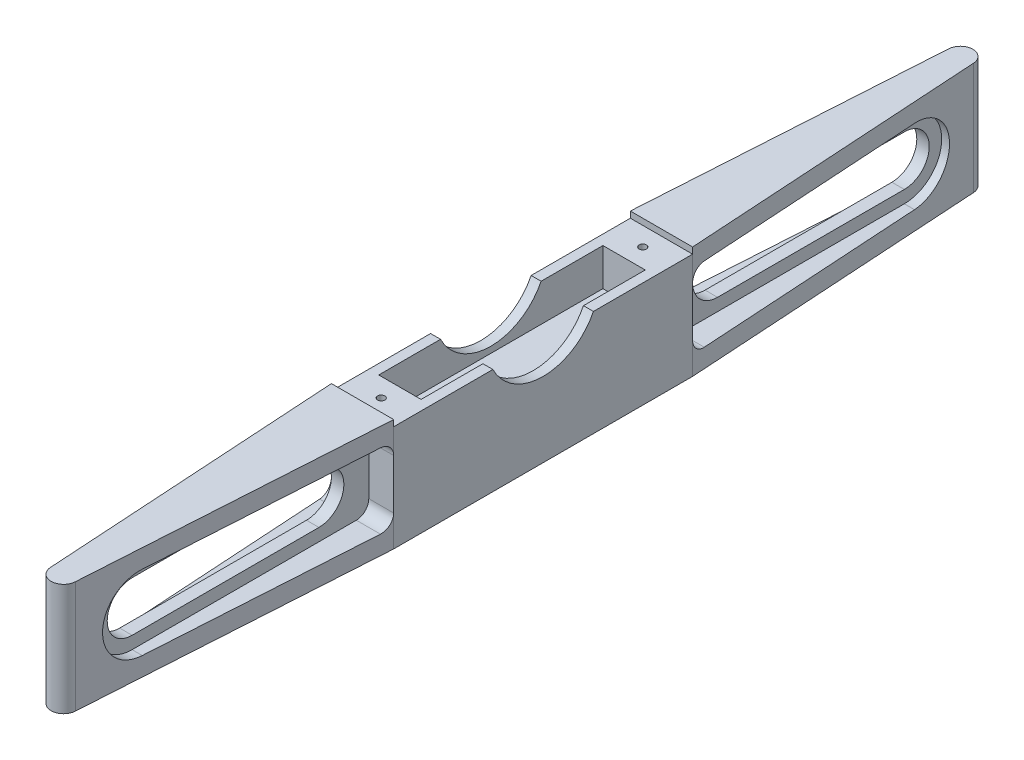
ISO-10303-21;
HEADER;
FILE_DESCRIPTION(('STEP AP214'),'2;1');
FILE_NAME('part.step','',(''),(''),'','','');
FILE_SCHEMA(('AUTOMOTIVE_DESIGN { 1 0 10303 214 1 1 1 1 }'));
ENDSEC;
DATA;
#1=APPLICATION_CONTEXT('core data for automotive mechanical design processes');
#2=APPLICATION_PROTOCOL_DEFINITION('international standard','automotive_design',2000,#1);
#3=PRODUCT_CONTEXT('',#1,'mechanical');
#4=PRODUCT('Part','Part','',(#3));
#5=PRODUCT_RELATED_PRODUCT_CATEGORY('part','',(#4));
#6=PRODUCT_DEFINITION_FORMATION('','',#4);
#7=PRODUCT_DEFINITION_CONTEXT('part definition',#1,'design');
#8=PRODUCT_DEFINITION('design','',#6,#7);
#9=PRODUCT_DEFINITION_SHAPE('','',#8);
#10=(LENGTH_UNIT() NAMED_UNIT(*) SI_UNIT(.MILLI.,.METRE.));
#11=(NAMED_UNIT(*) PLANE_ANGLE_UNIT() SI_UNIT($,.RADIAN.));
#12=(NAMED_UNIT(*) SI_UNIT($,.STERADIAN.) SOLID_ANGLE_UNIT());
#13=UNCERTAINTY_MEASURE_WITH_UNIT(LENGTH_MEASURE(1.E-05),#10,'distance_accuracy_value','');
#14=(GEOMETRIC_REPRESENTATION_CONTEXT(3) GLOBAL_UNCERTAINTY_ASSIGNED_CONTEXT((#13)) GLOBAL_UNIT_ASSIGNED_CONTEXT((#10,
#11,#12)) REPRESENTATION_CONTEXT('',''));
#15=CARTESIAN_POINT('',(0.,0.,0.));
#16=DIRECTION('',(0.,0.,1.));
#17=DIRECTION('',(1.,0.,0.));
#18=AXIS2_PLACEMENT_3D('',#15,#16,#17);
#19=CARTESIAN_POINT('',(-7.93749999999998,26.9875,-38.1));
#20=DIRECTION('',(0.,1.,0.));
#21=DIRECTION('',(0.,0.,1.));
#22=AXIS2_PLACEMENT_3D('',#19,#20,#21);
#23=PLANE('',#22);
#24=DIRECTION('',(1.,0.,0.));
#25=VECTOR('',#24,1.);
#26=CARTESIAN_POINT('',(-7.9375,26.9875,12.8130097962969));
#27=LINE('',#26,#25);
#28=CARTESIAN_POINT('',(-7.9375,26.9875,12.8130097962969));
#29=VERTEX_POINT('',#28);
#30=CARTESIAN_POINT('',(-5.39749999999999,26.9875,12.8130097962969));
#31=VERTEX_POINT('',#30);
#32=EDGE_CURVE('E41',#29,#31,#27,.T.);
#33=ORIENTED_EDGE('',*,*,#32,.F.);
#34=DIRECTION('',(0.,0.,-1.));
#35=VECTOR('',#34,1.);
#36=CARTESIAN_POINT('',(-7.93749999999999,26.9875,38.1));
#37=LINE('',#36,#35);
#38=CARTESIAN_POINT('',(-7.93749999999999,26.9875,38.1));
#39=VERTEX_POINT('',#38);
#40=EDGE_CURVE('E353',#39,#29,#37,.T.);
#41=ORIENTED_EDGE('',*,*,#40,.F.);
#42=DIRECTION('',(1.,0.,0.));
#43=VECTOR('',#42,1.);
#44=CARTESIAN_POINT('',(-7.93749999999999,26.9875,38.1));
#45=LINE('',#44,#43);
#46=CARTESIAN_POINT('',(7.9375,26.9875,38.1));
#47=VERTEX_POINT('',#46);
#48=EDGE_CURVE('E379',#39,#47,#45,.T.);
#49=ORIENTED_EDGE('',*,*,#48,.T.);
#50=DIRECTION('',(0.,0.,1.));
#51=VECTOR('',#50,1.);
#52=CARTESIAN_POINT('',(7.9375,26.9875,-38.1));
#53=LINE('',#52,#51);
#54=CARTESIAN_POINT('',(7.9375,26.9875,12.8130097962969));
#55=VERTEX_POINT('',#54);
#56=EDGE_CURVE('E370',#55,#47,#53,.T.);
#57=ORIENTED_EDGE('',*,*,#56,.F.);
#58=CARTESIAN_POINT('',(5.3975,26.9875,12.8130097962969));
#59=VERTEX_POINT('',#58);
#60=EDGE_CURVE('E360',#59,#55,#27,.T.);
#61=ORIENTED_EDGE('',*,*,#60,.F.);
#62=DIRECTION('',(0.,0.,1.));
#63=VECTOR('',#62,1.);
#64=CARTESIAN_POINT('',(5.39750000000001,26.9875,-28.575));
#65=LINE('',#64,#63);
#66=CARTESIAN_POINT('',(5.3975,26.9875,28.575));
#67=VERTEX_POINT('',#66);
#68=EDGE_CURVE('E798',#59,#67,#65,.T.);
#69=ORIENTED_EDGE('',*,*,#68,.T.);
#70=DIRECTION('',(1.,0.,0.));
#71=VECTOR('',#70,1.);
#72=CARTESIAN_POINT('',(-5.39749999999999,26.9875,28.575));
#73=LINE('',#72,#71);
#74=CARTESIAN_POINT('',(-5.39749999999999,26.9875,28.575));
#75=VERTEX_POINT('',#74);
#76=EDGE_CURVE('E358',#75,#67,#73,.T.);
#77=ORIENTED_EDGE('',*,*,#76,.F.);
#78=DIRECTION('',(0.,0.,-1.));
#79=VECTOR('',#78,1.);
#80=CARTESIAN_POINT('',(-5.39749999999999,26.9875,28.575));
#81=LINE('',#80,#79);
#82=EDGE_CURVE('E357',#75,#31,#81,.T.);
#83=ORIENTED_EDGE('',*,*,#82,.T.);
#84=EDGE_LOOP('',(#33,#41,#49,#57,#61,#69,#77,#83));
#85=FACE_BOUND('',#84,.T.);
#86=CARTESIAN_POINT('',(0.,26.9875,33.3375));
#87=DIRECTION('',(0.,-1.,0.));
#88=DIRECTION('',(0.,0.,-1.));
#89=AXIS2_PLACEMENT_3D('',#86,#87,#88);
#90=CIRCLE('',#89,0.927099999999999);
#91=CARTESIAN_POINT('',(0.,26.9875,32.4104));
#92=VERTEX_POINT('',#91);
#93=EDGE_CURVE('E811',#92,#92,#90,.T.);
#94=ORIENTED_EDGE('',*,*,#93,.T.);
#95=EDGE_LOOP('',(#94));
#96=FACE_BOUND('',#95,.T.);
#97=ADVANCED_FACE('F26',(#85,#96),#23,.T.);
#98=CARTESIAN_POINT('',(7.9375,28.575,-38.1));
#99=DIRECTION('',(1.,0.,0.));
#100=DIRECTION('',(0.,0.,-1.));
#101=AXIS2_PLACEMENT_3D('',#98,#99,#100);
#102=PLANE('',#101);
#103=CARTESIAN_POINT('',(7.9375,33.3375,0.));
#104=DIRECTION('',(1.,0.,0.));
#105=DIRECTION('',(0.,0.,-1.));
#106=AXIS2_PLACEMENT_3D('',#103,#104,#105);
#107=CIRCLE('',#106,14.3002);
#108=CARTESIAN_POINT('',(7.9375,26.9875,-12.8130097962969));
#109=VERTEX_POINT('',#108);
#110=EDGE_CURVE('E347',#55,#109,#107,.T.);
#111=ORIENTED_EDGE('',*,*,#110,.F.);
#112=ORIENTED_EDGE('',*,*,#56,.T.);
#113=DIRECTION('',(0.,-1.,0.));
#114=VECTOR('',#113,1.);
#115=CARTESIAN_POINT('',(7.9375,28.575,38.1));
#116=LINE('',#115,#114);
#117=CARTESIAN_POINT('',(7.9375,20.6375,38.1));
#118=VERTEX_POINT('',#117);
#119=EDGE_CURVE('E574',#47,#118,#116,.T.);
#120=ORIENTED_EDGE('',*,*,#119,.T.);
#121=DIRECTION('',(0.,-1.,0.));
#122=VECTOR('',#121,1.);
#123=CARTESIAN_POINT('',(7.9375,23.8125,38.1));
#124=LINE('',#123,#122);
#125=CARTESIAN_POINT('',(7.9375,7.9375,38.1));
#126=VERTEX_POINT('',#125);
#127=EDGE_CURVE('E490',#118,#126,#124,.T.);
#128=ORIENTED_EDGE('',*,*,#127,.T.);
#129=CARTESIAN_POINT('',(7.9375,0.,38.1));
#130=VERTEX_POINT('',#129);
#131=EDGE_CURVE('E547',#126,#130,#116,.T.);
#132=ORIENTED_EDGE('',*,*,#131,.T.);
#133=DIRECTION('',(0.,0.,1.));
#134=VECTOR('',#133,1.);
#135=CARTESIAN_POINT('',(7.9375,0.,-38.1));
#136=LINE('',#135,#134);
#137=CARTESIAN_POINT('',(7.9375,0.,-38.1));
#138=VERTEX_POINT('',#137);
#139=EDGE_CURVE('E509',#138,#130,#136,.T.);
#140=ORIENTED_EDGE('',*,*,#139,.F.);
#141=DIRECTION('',(0.,-1.,0.));
#142=VECTOR('',#141,1.);
#143=CARTESIAN_POINT('',(7.9375,28.575,-38.1));
#144=LINE('',#143,#142);
#145=CARTESIAN_POINT('',(7.9375,7.9375,-38.1));
#146=VERTEX_POINT('',#145);
#147=EDGE_CURVE('E553',#146,#138,#144,.T.);
#148=ORIENTED_EDGE('',*,*,#147,.F.);
#149=DIRECTION('',(0.,-1.,0.));
#150=VECTOR('',#149,1.);
#151=CARTESIAN_POINT('',(7.9375,23.8125,-38.1));
#152=LINE('',#151,#150);
#153=CARTESIAN_POINT('',(7.9375,20.6375,-38.1));
#154=VERTEX_POINT('',#153);
#155=EDGE_CURVE('E433',#154,#146,#152,.T.);
#156=ORIENTED_EDGE('',*,*,#155,.F.);
#157=CARTESIAN_POINT('',(7.9375,26.9875,-38.1));
#158=VERTEX_POINT('',#157);
#159=EDGE_CURVE('E552',#158,#154,#144,.T.);
#160=ORIENTED_EDGE('',*,*,#159,.F.);
#161=EDGE_CURVE('E376',#158,#109,#53,.T.);
#162=ORIENTED_EDGE('',*,*,#161,.T.);
#163=EDGE_LOOP('',(#111,#112,#120,#128,#132,#140,#148,#156,#160,#162));
#164=FACE_BOUND('',#163,.T.);
#165=ADVANCED_FACE('F28',(#164),#102,.T.);
#166=CARTESIAN_POINT('',(-7.9375,28.575,-38.1));
#167=DIRECTION('',(1.,0.,0.));
#168=DIRECTION('',(0.,0.,-1.));
#169=AXIS2_PLACEMENT_3D('',#166,#167,#168);
#170=PLANE('',#169);
#171=ORIENTED_EDGE('',*,*,#40,.T.);
#172=CARTESIAN_POINT('',(-7.9375,33.3375,0.));
#173=DIRECTION('',(1.,0.,0.));
#174=DIRECTION('',(0.,0.,-1.));
#175=AXIS2_PLACEMENT_3D('',#172,#173,#174);
#176=CIRCLE('',#175,14.3002);
#177=CARTESIAN_POINT('',(-7.9375,26.9875,-12.8130097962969));
#178=VERTEX_POINT('',#177);
#179=EDGE_CURVE('E340',#29,#178,#176,.T.);
#180=ORIENTED_EDGE('',*,*,#179,.T.);
#181=CARTESIAN_POINT('',(-7.93749999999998,26.9875,-38.1));
#182=VERTEX_POINT('',#181);
#183=EDGE_CURVE('E367',#178,#182,#37,.T.);
#184=ORIENTED_EDGE('',*,*,#183,.T.);
#185=DIRECTION('',(0.,-1.,0.));
#186=VECTOR('',#185,1.);
#187=CARTESIAN_POINT('',(-7.9375,28.575,-38.1));
#188=LINE('',#187,#186);
#189=CARTESIAN_POINT('',(-7.9375,20.6375,-38.1));
#190=VERTEX_POINT('',#189);
#191=EDGE_CURVE('E561',#182,#190,#188,.T.);
#192=ORIENTED_EDGE('',*,*,#191,.T.);
#193=DIRECTION('',(0.,-1.,0.));
#194=VECTOR('',#193,1.);
#195=CARTESIAN_POINT('',(-7.9375,23.8125,-38.1));
#196=LINE('',#195,#194);
#197=CARTESIAN_POINT('',(-7.9375,7.9375,-38.1));
#198=VERTEX_POINT('',#197);
#199=EDGE_CURVE('E452',#190,#198,#196,.T.);
#200=ORIENTED_EDGE('',*,*,#199,.T.);
#201=CARTESIAN_POINT('',(-7.9375,0.,-38.1));
#202=VERTEX_POINT('',#201);
#203=EDGE_CURVE('E562',#198,#202,#188,.T.);
#204=ORIENTED_EDGE('',*,*,#203,.T.);
#205=DIRECTION('',(0.,0.,1.));
#206=VECTOR('',#205,1.);
#207=CARTESIAN_POINT('',(-7.9375,0.,-38.1));
#208=LINE('',#207,#206);
#209=CARTESIAN_POINT('',(-7.93749999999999,0.,38.1));
#210=VERTEX_POINT('',#209);
#211=EDGE_CURVE('E520',#202,#210,#208,.T.);
#212=ORIENTED_EDGE('',*,*,#211,.T.);
#213=DIRECTION('',(0.,-1.,0.));
#214=VECTOR('',#213,1.);
#215=CARTESIAN_POINT('',(-7.93749999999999,28.575,38.1));
#216=LINE('',#215,#214);
#217=CARTESIAN_POINT('',(-7.9375,7.9375,38.1));
#218=VERTEX_POINT('',#217);
#219=EDGE_CURVE('E565',#218,#210,#216,.T.);
#220=ORIENTED_EDGE('',*,*,#219,.F.);
#221=DIRECTION('',(0.,-1.,0.));
#222=VECTOR('',#221,1.);
#223=CARTESIAN_POINT('',(-7.9375,23.8125,38.1));
#224=LINE('',#223,#222);
#225=CARTESIAN_POINT('',(-7.93749999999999,20.6375,38.1));
#226=VERTEX_POINT('',#225);
#227=EDGE_CURVE('E471',#226,#218,#224,.T.);
#228=ORIENTED_EDGE('',*,*,#227,.F.);
#229=EDGE_CURVE('E364',#39,#226,#216,.T.);
#230=ORIENTED_EDGE('',*,*,#229,.F.);
#231=EDGE_LOOP('',(#171,#180,#184,#192,#200,#204,#212,#220,#228,#230));
#232=FACE_BOUND('',#231,.T.);
#233=ADVANCED_FACE('F362',(#232),#170,.F.);
#234=CARTESIAN_POINT('',(0.,28.575,114.3));
#235=DIRECTION('',(0.,1.,0.));
#236=DIRECTION('',(0.,0.,1.));
#237=AXIS2_PLACEMENT_3D('',#234,#235,#236);
#238=PLANE('',#237);
#239=DIRECTION('',(-1.,0.,0.));
#240=VECTOR('',#239,1.);
#241=CARTESIAN_POINT('',(7.9375,28.575,-38.1));
#242=LINE('',#241,#240);
#243=CARTESIAN_POINT('',(7.9375,28.575,-38.1));
#244=VERTEX_POINT('',#243);
#245=CARTESIAN_POINT('',(-7.93749999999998,28.575,-38.1));
#246=VERTEX_POINT('',#245);
#247=EDGE_CURVE('E767',#244,#246,#242,.T.);
#248=ORIENTED_EDGE('',*,*,#247,.F.);
#249=DIRECTION('',(-0.0622976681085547,0.,-0.998057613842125));
#250=VECTOR('',#249,1.);
#251=CARTESIAN_POINT('',(7.9375,28.575,-38.1));
#252=LINE('',#251,#250);
#253=CARTESIAN_POINT('',(3.16883292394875,28.575,-114.497795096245));
#254=VERTEX_POINT('',#253);
#255=EDGE_CURVE('E545',#244,#254,#252,.T.);
#256=ORIENTED_EDGE('',*,*,#255,.T.);
#257=CARTESIAN_POINT('',(0.,28.575,-114.3));
#258=DIRECTION('',(0.,-1.,0.));
#259=DIRECTION('',(0.,0.,-1.));
#260=AXIS2_PLACEMENT_3D('',#257,#258,#259);
#261=CIRCLE('',#260,3.17500000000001);
#262=CARTESIAN_POINT('',(-3.16883292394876,28.575,-114.497795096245));
#263=VERTEX_POINT('',#262);
#264=EDGE_CURVE('E542',#263,#254,#261,.T.);
#265=ORIENTED_EDGE('',*,*,#264,.F.);
#266=DIRECTION('',(0.0622976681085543,0.,-0.998057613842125));
#267=VECTOR('',#266,1.);
#268=CARTESIAN_POINT('',(-7.9375,28.575,-38.1));
#269=LINE('',#268,#267);
#270=EDGE_CURVE('E539',#246,#263,#269,.T.);
#271=ORIENTED_EDGE('',*,*,#270,.F.);
#272=EDGE_LOOP('',(#248,#256,#265,#271));
#273=FACE_BOUND('',#272,.T.);
#274=ADVANCED_FACE('F771',(#273),#238,.T.);
#275=CARTESIAN_POINT('',(1.5875,14.2875,98.425));
#276=DIRECTION('',(-1.,0.,0.));
#277=DIRECTION('',(0.,0.,1.));
#278=AXIS2_PLACEMENT_3D('',#275,#276,#277);
#279=PLANE('',#278);
#280=DIRECTION('',(0.,0.,1.));
#281=VECTOR('',#280,1.);
#282=CARTESIAN_POINT('',(1.5875,4.7625,38.1));
#283=LINE('',#282,#281);
#284=CARTESIAN_POINT('',(1.5875,4.7625,41.275));
#285=VERTEX_POINT('',#284);
#286=CARTESIAN_POINT('',(1.5875,4.76250000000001,98.425));
#287=VERTEX_POINT('',#286);
#288=EDGE_CURVE('E496',#285,#287,#283,.T.);
#289=ORIENTED_EDGE('',*,*,#288,.F.);
#290=CARTESIAN_POINT('',(1.5875,7.9375,41.275));
#291=DIRECTION('',(-1.,0.,0.));
#292=DIRECTION('',(0.,0.,1.));
#293=AXIS2_PLACEMENT_3D('',#290,#291,#292);
#294=CIRCLE('',#293,3.175);
#295=CARTESIAN_POINT('',(1.5875,7.9375,38.1));
#296=VERTEX_POINT('',#295);
#297=EDGE_CURVE('E590',#285,#296,#294,.F.);
#298=ORIENTED_EDGE('',*,*,#297,.T.);
#299=DIRECTION('',(0.,-1.,0.));
#300=VECTOR('',#299,1.);
#301=CARTESIAN_POINT('',(1.5875,23.8125,38.1));
#302=LINE('',#301,#300);
#303=CARTESIAN_POINT('',(1.5875,20.6375,38.1));
#304=VERTEX_POINT('',#303);
#305=EDGE_CURVE('E493',#304,#296,#302,.T.);
#306=ORIENTED_EDGE('',*,*,#305,.F.);
#307=CARTESIAN_POINT('',(1.5875,20.6375,41.275));
#308=DIRECTION('',(-1.,0.,0.));
#309=DIRECTION('',(0.,0.,1.));
#310=AXIS2_PLACEMENT_3D('',#307,#308,#309);
#311=CIRCLE('',#310,3.175);
#312=CARTESIAN_POINT('',(1.5875,23.8125,41.275));
#313=VERTEX_POINT('',#312);
#314=EDGE_CURVE('E588',#304,#313,#311,.F.);
#315=ORIENTED_EDGE('',*,*,#314,.T.);
#316=DIRECTION('',(0.,0.,1.));
#317=VECTOR('',#316,1.);
#318=CARTESIAN_POINT('',(1.5875,23.8125,38.1));
#319=LINE('',#318,#317);
#320=CARTESIAN_POINT('',(1.5875,23.8125,98.425));
#321=VERTEX_POINT('',#320);
#322=EDGE_CURVE('E501',#313,#321,#319,.T.);
#323=ORIENTED_EDGE('',*,*,#322,.T.);
#324=CARTESIAN_POINT('',(1.5875,14.2875,98.425));
#325=DIRECTION('',(-1.,0.,0.));
#326=DIRECTION('',(0.,0.,1.));
#327=AXIS2_PLACEMENT_3D('',#324,#325,#326);
#328=CIRCLE('',#327,9.525);
#329=EDGE_CURVE('E498',#287,#321,#328,.T.);
#330=ORIENTED_EDGE('',*,*,#329,.F.);
#331=EDGE_LOOP('',(#289,#298,#306,#315,#323,#330));
#332=FACE_BOUND('',#331,.T.);
#333=CARTESIAN_POINT('',(1.5875,14.2875,50.8));
#334=DIRECTION('',(-1.,0.,0.));
#335=DIRECTION('',(0.,0.,1.));
#336=AXIS2_PLACEMENT_3D('',#333,#334,#335);
#337=CIRCLE('',#336,6.35);
#338=CARTESIAN_POINT('',(1.5875,20.6375,50.8));
#339=VERTEX_POINT('',#338);
#340=CARTESIAN_POINT('',(1.5875,7.9375,50.8));
#341=VERTEX_POINT('',#340);
#342=EDGE_CURVE('E412',#339,#341,#337,.T.);
#343=ORIENTED_EDGE('',*,*,#342,.T.);
#344=DIRECTION('',(0.,0.,1.));
#345=VECTOR('',#344,1.);
#346=CARTESIAN_POINT('',(1.5875,7.9375,50.8));
#347=LINE('',#346,#345);
#348=CARTESIAN_POINT('',(1.5875,7.93750000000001,98.425));
#349=VERTEX_POINT('',#348);
#350=EDGE_CURVE('E415',#341,#349,#347,.T.);
#351=ORIENTED_EDGE('',*,*,#350,.T.);
#352=CARTESIAN_POINT('',(1.5875,14.2875,98.425));
#353=DIRECTION('',(1.,0.,0.));
#354=DIRECTION('',(0.,0.,-1.));
#355=AXIS2_PLACEMENT_3D('',#352,#353,#354);
#356=CIRCLE('',#355,6.35);
#357=CARTESIAN_POINT('',(1.5875,20.6375,98.425));
#358=VERTEX_POINT('',#357);
#359=EDGE_CURVE('E418',#358,#349,#356,.T.);
#360=ORIENTED_EDGE('',*,*,#359,.F.);
#361=DIRECTION('',(0.,0.,1.));
#362=VECTOR('',#361,1.);
#363=CARTESIAN_POINT('',(1.5875,20.6375,50.8));
#364=LINE('',#363,#362);
#365=EDGE_CURVE('E421',#339,#358,#364,.T.);
#366=ORIENTED_EDGE('',*,*,#365,.F.);
#367=EDGE_LOOP('',(#343,#351,#360,#366));
#368=FACE_BOUND('',#367,.T.);
#369=ADVANCED_FACE('F707',(#332,#368),#279,.F.);
#370=CARTESIAN_POINT('',(-1.5875,14.2875,98.425));
#371=DIRECTION('',(1.,0.,0.));
#372=DIRECTION('',(0.,0.,1.));
#373=AXIS2_PLACEMENT_3D('',#370,#371,#372);
#374=PLANE('',#373);
#375=DIRECTION('',(0.,-1.,0.));
#376=VECTOR('',#375,1.);
#377=CARTESIAN_POINT('',(-1.5875,23.8125,38.1));
#378=LINE('',#377,#376);
#379=CARTESIAN_POINT('',(-1.5875,20.6375,38.1));
#380=VERTEX_POINT('',#379);
#381=CARTESIAN_POINT('',(-1.5875,7.9375,38.1));
#382=VERTEX_POINT('',#381);
#383=EDGE_CURVE('E474',#380,#382,#378,.T.);
#384=ORIENTED_EDGE('',*,*,#383,.T.);
#385=CARTESIAN_POINT('',(-1.5875,7.9375,41.275));
#386=DIRECTION('',(1.,0.,0.));
#387=DIRECTION('',(0.,0.,-1.));
#388=AXIS2_PLACEMENT_3D('',#385,#386,#387);
#389=CIRCLE('',#388,3.175);
#390=CARTESIAN_POINT('',(-1.5875,4.7625,41.275));
#391=VERTEX_POINT('',#390);
#392=EDGE_CURVE('E619',#382,#391,#389,.F.);
#393=ORIENTED_EDGE('',*,*,#392,.T.);
#394=DIRECTION('',(0.,0.,1.));
#395=VECTOR('',#394,1.);
#396=CARTESIAN_POINT('',(-1.5875,4.7625,38.1));
#397=LINE('',#396,#395);
#398=CARTESIAN_POINT('',(-1.5875,4.76250000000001,98.425));
#399=VERTEX_POINT('',#398);
#400=EDGE_CURVE('E482',#391,#399,#397,.T.);
#401=ORIENTED_EDGE('',*,*,#400,.T.);
#402=CARTESIAN_POINT('',(-1.5875,14.2875,98.425));
#403=DIRECTION('',(-1.,0.,0.));
#404=DIRECTION('',(0.,0.,1.));
#405=AXIS2_PLACEMENT_3D('',#402,#403,#404);
#406=CIRCLE('',#405,9.525);
#407=CARTESIAN_POINT('',(-1.5875,23.8125,98.425));
#408=VERTEX_POINT('',#407);
#409=EDGE_CURVE('E479',#399,#408,#406,.T.);
#410=ORIENTED_EDGE('',*,*,#409,.T.);
#411=DIRECTION('',(0.,0.,1.));
#412=VECTOR('',#411,1.);
#413=CARTESIAN_POINT('',(-1.5875,23.8125,38.1));
#414=LINE('',#413,#412);
#415=CARTESIAN_POINT('',(-1.5875,23.8125,41.275));
#416=VERTEX_POINT('',#415);
#417=EDGE_CURVE('E477',#416,#408,#414,.T.);
#418=ORIENTED_EDGE('',*,*,#417,.F.);
#419=CARTESIAN_POINT('',(-1.5875,20.6375,41.275));
#420=DIRECTION('',(1.,0.,0.));
#421=DIRECTION('',(0.,0.,-1.));
#422=AXIS2_PLACEMENT_3D('',#419,#420,#421);
#423=CIRCLE('',#422,3.175);
#424=EDGE_CURVE('E617',#416,#380,#423,.F.);
#425=ORIENTED_EDGE('',*,*,#424,.T.);
#426=EDGE_LOOP('',(#384,#393,#401,#410,#418,#425));
#427=FACE_BOUND('',#426,.T.);
#428=CARTESIAN_POINT('',(-1.5875,14.2875,50.8));
#429=DIRECTION('',(1.,0.,0.));
#430=DIRECTION('',(0.,0.,-1.));
#431=AXIS2_PLACEMENT_3D('',#428,#429,#430);
#432=CIRCLE('',#431,6.35);
#433=CARTESIAN_POINT('',(-1.5875,20.6375,50.8));
#434=VERTEX_POINT('',#433);
#435=CARTESIAN_POINT('',(-1.5875,7.9375,50.8));
#436=VERTEX_POINT('',#435);
#437=EDGE_CURVE('E34',#434,#436,#432,.F.);
#438=ORIENTED_EDGE('',*,*,#437,.F.);
#439=DIRECTION('',(0.,0.,1.));
#440=VECTOR('',#439,1.);
#441=CARTESIAN_POINT('',(-1.5875,20.6375,98.425));
#442=LINE('',#441,#440);
#443=CARTESIAN_POINT('',(-1.5875,20.6375,98.425));
#444=VERTEX_POINT('',#443);
#445=EDGE_CURVE('E682',#434,#444,#442,.T.);
#446=ORIENTED_EDGE('',*,*,#445,.T.);
#447=CARTESIAN_POINT('',(-1.5875,14.2875,98.425));
#448=DIRECTION('',(1.,0.,0.));
#449=DIRECTION('',(0.,0.,-1.));
#450=AXIS2_PLACEMENT_3D('',#447,#448,#449);
#451=CIRCLE('',#450,6.35);
#452=CARTESIAN_POINT('',(-1.5875,7.93750000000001,98.425));
#453=VERTEX_POINT('',#452);
#454=EDGE_CURVE('E685',#444,#453,#451,.T.);
#455=ORIENTED_EDGE('',*,*,#454,.T.);
#456=DIRECTION('',(0.,0.,1.));
#457=VECTOR('',#456,1.);
#458=CARTESIAN_POINT('',(-1.5875,7.93750000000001,98.425));
#459=LINE('',#458,#457);
#460=EDGE_CURVE('E688',#436,#453,#459,.T.);
#461=ORIENTED_EDGE('',*,*,#460,.F.);
#462=EDGE_LOOP('',(#438,#446,#455,#461));
#463=FACE_BOUND('',#462,.T.);
#464=ADVANCED_FACE('F700',(#427,#463),#374,.F.);
#465=CARTESIAN_POINT('',(7.9375,28.575,-38.1));
#466=DIRECTION('',(-0.998057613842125,0.,0.0622976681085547));
#467=DIRECTION('',(0.0622976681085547,0.,0.998057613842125));
#468=AXIS2_PLACEMENT_3D('',#465,#466,#467);
#469=PLANE('',#468);
#470=DIRECTION('',(0.0622976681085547,0.,0.998057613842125));
#471=VECTOR('',#470,1.);
#472=CARTESIAN_POINT('',(7.9375,23.8125,-38.1));
#473=LINE('',#472,#471);
#474=CARTESIAN_POINT('',(4.17207927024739,23.8125,-98.425));
#475=VERTEX_POINT('',#474);
#476=CARTESIAN_POINT('',(7.73931996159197,23.8125,-41.275));
#477=VERTEX_POINT('',#476);
#478=EDGE_CURVE('E660',#475,#477,#473,.T.);
#479=ORIENTED_EDGE('',*,*,#478,.F.);
#480=CARTESIAN_POINT('',(4.17207927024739,14.2875,-98.425));
#481=DIRECTION('',(-0.998057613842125,0.,0.0622976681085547));
#482=DIRECTION('',(0.0622976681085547,0.,0.998057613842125));
#483=AXIS2_PLACEMENT_3D('',#480,#481,#482);
#484=ELLIPSE('',#483,9.54353723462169,9.525);
#485=CARTESIAN_POINT('',(4.17207927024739,4.76250000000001,-98.425));
#486=VERTEX_POINT('',#485);
#487=EDGE_CURVE('E657',#475,#486,#484,.T.);
#488=ORIENTED_EDGE('',*,*,#487,.T.);
#489=DIRECTION('',(0.0622976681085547,0.,0.998057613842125));
#490=VECTOR('',#489,1.);
#491=CARTESIAN_POINT('',(7.9375,4.7625,-38.1));
#492=LINE('',#491,#490);
#493=CARTESIAN_POINT('',(7.73931996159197,4.7625,-41.275));
#494=VERTEX_POINT('',#493);
#495=EDGE_CURVE('E654',#486,#494,#492,.T.);
#496=ORIENTED_EDGE('',*,*,#495,.T.);
#497=CARTESIAN_POINT('',(7.73931996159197,7.9375,-41.275));
#498=DIRECTION('',(-0.998057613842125,0.,0.0622976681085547));
#499=DIRECTION('',(-0.0622976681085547,0.,-0.998057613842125));
#500=AXIS2_PLACEMENT_3D('',#497,#498,#499);
#501=ELLIPSE('',#500,3.18117907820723,3.175);
#502=EDGE_CURVE('E677',#494,#146,#501,.T.);
#503=ORIENTED_EDGE('',*,*,#502,.T.);
#504=ORIENTED_EDGE('',*,*,#147,.T.);
#505=DIRECTION('',(-0.0622976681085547,0.,-0.998057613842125));
#506=VECTOR('',#505,1.);
#507=CARTESIAN_POINT('',(7.9375,0.,-38.1));
#508=LINE('',#507,#506);
#509=CARTESIAN_POINT('',(3.16883292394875,0.,-114.497795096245));
#510=VERTEX_POINT('',#509);
#511=EDGE_CURVE('E529',#138,#510,#508,.T.);
#512=ORIENTED_EDGE('',*,*,#511,.T.);
#513=DIRECTION('',(0.,-1.,0.));
#514=VECTOR('',#513,1.);
#515=CARTESIAN_POINT('',(3.16883292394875,28.575,-114.497795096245));
#516=LINE('',#515,#514);
#517=EDGE_CURVE('E554',#254,#510,#516,.T.);
#518=ORIENTED_EDGE('',*,*,#517,.F.);
#519=ORIENTED_EDGE('',*,*,#255,.F.);
#520=EDGE_CURVE('E548',#244,#158,#144,.T.);
#521=ORIENTED_EDGE('',*,*,#520,.T.);
#522=ORIENTED_EDGE('',*,*,#159,.T.);
#523=CARTESIAN_POINT('',(7.73931996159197,20.6375,-41.275));
#524=DIRECTION('',(-0.998057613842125,0.,0.0622976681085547));
#525=DIRECTION('',(0.0622976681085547,0.,0.998057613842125));
#526=AXIS2_PLACEMENT_3D('',#523,#524,#525);
#527=ELLIPSE('',#526,3.18117907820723,3.175);
#528=EDGE_CURVE('E680',#154,#477,#527,.T.);
#529=ORIENTED_EDGE('',*,*,#528,.T.);
#530=EDGE_LOOP('',(#479,#488,#496,#503,#504,#512,#518,#519,#521,#522,#529));
#531=FACE_BOUND('',#530,.T.);
#532=ADVANCED_FACE('F763',(#531),#469,.F.);
#533=CARTESIAN_POINT('',(-7.9375,28.575,-38.1));
#534=DIRECTION('',(-0.998057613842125,0.,-0.0622976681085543));
#535=DIRECTION('',(-0.0622976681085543,0.,0.998057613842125));
#536=AXIS2_PLACEMENT_3D('',#533,#534,#535);
#537=PLANE('',#536);
#538=ORIENTED_EDGE('',*,*,#203,.F.);
#539=CARTESIAN_POINT('',(-7.73931996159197,7.9375,-41.275));
#540=DIRECTION('',(-0.998057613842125,0.,-0.0622976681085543));
#541=DIRECTION('',(0.0622976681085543,0.,-0.998057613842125));
#542=AXIS2_PLACEMENT_3D('',#539,#540,#541);
#543=ELLIPSE('',#542,3.18117907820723,3.175);
#544=CARTESIAN_POINT('',(-7.73931996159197,4.7625,-41.275));
#545=VERTEX_POINT('',#544);
#546=EDGE_CURVE('E649',#198,#545,#543,.F.);
#547=ORIENTED_EDGE('',*,*,#546,.T.);
#548=DIRECTION('',(0.0622976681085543,0.,-0.998057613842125));
#549=VECTOR('',#548,1.);
#550=CARTESIAN_POINT('',(-7.9375,4.7625,-38.1));
#551=LINE('',#550,#549);
#552=CARTESIAN_POINT('',(-4.17207927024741,4.76250000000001,-98.425));
#553=VERTEX_POINT('',#552);
#554=EDGE_CURVE('E633',#545,#553,#551,.T.);
#555=ORIENTED_EDGE('',*,*,#554,.T.);
#556=CARTESIAN_POINT('',(-4.17207927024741,14.2875,-98.425));
#557=DIRECTION('',(-0.998057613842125,0.,-0.0622976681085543));
#558=DIRECTION('',(-0.0622976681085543,0.,0.998057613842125));
#559=AXIS2_PLACEMENT_3D('',#556,#557,#558);
#560=ELLIPSE('',#559,9.54353723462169,9.525);
#561=CARTESIAN_POINT('',(-4.17207927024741,23.8125,-98.425));
#562=VERTEX_POINT('',#561);
#563=EDGE_CURVE('E630',#553,#562,#560,.F.);
#564=ORIENTED_EDGE('',*,*,#563,.T.);
#565=DIRECTION('',(0.0622976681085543,0.,-0.998057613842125));
#566=VECTOR('',#565,1.);
#567=CARTESIAN_POINT('',(-7.9375,23.8125,-38.1));
#568=LINE('',#567,#566);
#569=CARTESIAN_POINT('',(-7.73931996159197,23.8125,-41.275));
#570=VERTEX_POINT('',#569);
#571=EDGE_CURVE('E628',#570,#562,#568,.T.);
#572=ORIENTED_EDGE('',*,*,#571,.F.);
#573=CARTESIAN_POINT('',(-7.73931996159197,20.6375,-41.275));
#574=DIRECTION('',(-0.998057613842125,0.,-0.0622976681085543));
#575=DIRECTION('',(-0.0622976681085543,0.,0.998057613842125));
#576=AXIS2_PLACEMENT_3D('',#573,#574,#575);
#577=ELLIPSE('',#576,3.18117907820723,3.175);
#578=EDGE_CURVE('E651',#570,#190,#577,.F.);
#579=ORIENTED_EDGE('',*,*,#578,.T.);
#580=ORIENTED_EDGE('',*,*,#191,.F.);
#581=EDGE_CURVE('E558',#246,#182,#188,.T.);
#582=ORIENTED_EDGE('',*,*,#581,.F.);
#583=ORIENTED_EDGE('',*,*,#270,.T.);
#584=DIRECTION('',(0.,-1.,0.));
#585=VECTOR('',#584,1.);
#586=CARTESIAN_POINT('',(-3.16883292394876,28.575,-114.497795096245));
#587=LINE('',#586,#585);
#588=CARTESIAN_POINT('',(-3.16883292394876,0.,-114.497795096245));
#589=VERTEX_POINT('',#588);
#590=EDGE_CURVE('E556',#263,#589,#587,.T.);
#591=ORIENTED_EDGE('',*,*,#590,.T.);
#592=DIRECTION('',(0.0622976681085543,0.,-0.998057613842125));
#593=VECTOR('',#592,1.);
#594=CARTESIAN_POINT('',(-7.9375,0.,-38.1));
#595=LINE('',#594,#593);
#596=EDGE_CURVE('E523',#202,#589,#595,.T.);
#597=ORIENTED_EDGE('',*,*,#596,.F.);
#598=EDGE_LOOP('',(#538,#547,#555,#564,#572,#579,#580,#582,#583,#591,#597));
#599=FACE_BOUND('',#598,.T.);
#600=ADVANCED_FACE('F930',(#599),#537,.T.);
#601=CARTESIAN_POINT('',(-7.93749999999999,28.575,38.1));
#602=DIRECTION('',(0.998057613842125,0.,-0.062297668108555));
#603=DIRECTION('',(-0.062297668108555,0.,-0.998057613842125));
#604=AXIS2_PLACEMENT_3D('',#601,#602,#603);
#605=PLANE('',#604);
#606=DIRECTION('',(-0.062297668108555,0.,-0.998057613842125));
#607=VECTOR('',#606,1.);
#608=CARTESIAN_POINT('',(-7.93749999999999,23.8125,38.1));
#609=LINE('',#608,#607);
#610=CARTESIAN_POINT('',(-4.17207927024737,23.8125,98.425));
#611=VERTEX_POINT('',#610);
#612=CARTESIAN_POINT('',(-7.73931996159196,23.8125,41.275));
#613=VERTEX_POINT('',#612);
#614=EDGE_CURVE('E606',#611,#613,#609,.T.);
#615=ORIENTED_EDGE('',*,*,#614,.F.);
#616=CARTESIAN_POINT('',(-4.17207927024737,14.2875,98.425));
#617=DIRECTION('',(0.998057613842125,0.,-0.062297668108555));
#618=DIRECTION('',(-0.062297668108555,0.,-0.998057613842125));
#619=AXIS2_PLACEMENT_3D('',#616,#617,#618);
#620=ELLIPSE('',#619,9.54353723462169,9.525);
#621=CARTESIAN_POINT('',(-4.17207927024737,4.76250000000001,98.425));
#622=VERTEX_POINT('',#621);
#623=EDGE_CURVE('E603',#611,#622,#620,.T.);
#624=ORIENTED_EDGE('',*,*,#623,.T.);
#625=DIRECTION('',(-0.062297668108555,0.,-0.998057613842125));
#626=VECTOR('',#625,1.);
#627=CARTESIAN_POINT('',(-7.93749999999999,4.7625,38.1));
#628=LINE('',#627,#626);
#629=CARTESIAN_POINT('',(-7.73931996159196,4.7625,41.275));
#630=VERTEX_POINT('',#629);
#631=EDGE_CURVE('E600',#622,#630,#628,.T.);
#632=ORIENTED_EDGE('',*,*,#631,.T.);
#633=CARTESIAN_POINT('',(-7.73931996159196,7.9375,41.275));
#634=DIRECTION('',(0.998057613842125,0.,-0.062297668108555));
#635=DIRECTION('',(0.062297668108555,0.,0.998057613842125));
#636=AXIS2_PLACEMENT_3D('',#633,#634,#635);
#637=ELLIPSE('',#636,3.18117907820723,3.175);
#638=EDGE_CURVE('E623',#630,#218,#637,.T.);
#639=ORIENTED_EDGE('',*,*,#638,.T.);
#640=ORIENTED_EDGE('',*,*,#219,.T.);
#641=DIRECTION('',(0.062297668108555,0.,0.998057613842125));
#642=VECTOR('',#641,1.);
#643=CARTESIAN_POINT('',(-7.93749999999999,0.,38.1));
#644=LINE('',#643,#642);
#645=CARTESIAN_POINT('',(-3.16883292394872,0.,114.497795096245));
#646=VERTEX_POINT('',#645);
#647=EDGE_CURVE('E518',#210,#646,#644,.T.);
#648=ORIENTED_EDGE('',*,*,#647,.T.);
#649=DIRECTION('',(0.,-1.,0.));
#650=VECTOR('',#649,1.);
#651=CARTESIAN_POINT('',(-3.16883292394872,28.575,114.497795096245));
#652=LINE('',#651,#650);
#653=CARTESIAN_POINT('',(-3.16883292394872,28.575,114.497795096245));
#654=VERTEX_POINT('',#653);
#655=EDGE_CURVE('E566',#654,#646,#652,.T.);
#656=ORIENTED_EDGE('',*,*,#655,.F.);
#657=DIRECTION('',(0.062297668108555,0.,0.998057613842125));
#658=VECTOR('',#657,1.);
#659=CARTESIAN_POINT('',(-7.93749999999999,28.575,38.1));
#660=LINE('',#659,#658);
#661=CARTESIAN_POINT('',(-7.93749999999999,28.575,38.1));
#662=VERTEX_POINT('',#661);
#663=EDGE_CURVE('E537',#662,#654,#660,.T.);
#664=ORIENTED_EDGE('',*,*,#663,.F.);
#665=EDGE_CURVE('E563',#662,#39,#216,.T.);
#666=ORIENTED_EDGE('',*,*,#665,.T.);
#667=ORIENTED_EDGE('',*,*,#229,.T.);
#668=CARTESIAN_POINT('',(-7.73931996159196,20.6375,41.275));
#669=DIRECTION('',(0.998057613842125,0.,-0.062297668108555));
#670=DIRECTION('',(-0.062297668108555,0.,-0.998057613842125));
#671=AXIS2_PLACEMENT_3D('',#668,#669,#670);
#672=ELLIPSE('',#671,3.18117907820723,3.175);
#673=EDGE_CURVE('E626',#226,#613,#672,.T.);
#674=ORIENTED_EDGE('',*,*,#673,.T.);
#675=EDGE_LOOP('',(#615,#624,#632,#639,#640,#648,#656,#664,#666,#667,#674));
#676=FACE_BOUND('',#675,.T.);
#677=ADVANCED_FACE('F937',(#676),#605,.F.);
#678=CARTESIAN_POINT('',(7.9375,28.575,38.1));
#679=DIRECTION('',(0.998057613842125,0.,0.0622976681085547));
#680=DIRECTION('',(0.0622976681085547,0.,-0.998057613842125));
#681=AXIS2_PLACEMENT_3D('',#678,#679,#680);
#682=PLANE('',#681);
#683=ORIENTED_EDGE('',*,*,#131,.F.);
#684=CARTESIAN_POINT('',(7.73931996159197,7.9375,41.275));
#685=DIRECTION('',(0.998057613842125,0.,0.0622976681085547));
#686=DIRECTION('',(-0.0622976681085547,0.,0.998057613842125));
#687=AXIS2_PLACEMENT_3D('',#684,#685,#686);
#688=ELLIPSE('',#687,3.18117907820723,3.175);
#689=CARTESIAN_POINT('',(7.73931996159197,4.7625,41.275));
#690=VERTEX_POINT('',#689);
#691=EDGE_CURVE('E595',#126,#690,#688,.F.);
#692=ORIENTED_EDGE('',*,*,#691,.T.);
#693=DIRECTION('',(-0.0622976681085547,0.,0.998057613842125));
#694=VECTOR('',#693,1.);
#695=CARTESIAN_POINT('',(7.9375,4.7625,38.1));
#696=LINE('',#695,#694);
#697=CARTESIAN_POINT('',(4.17207927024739,4.76250000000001,98.425));
#698=VERTEX_POINT('',#697);
#699=EDGE_CURVE('E579',#690,#698,#696,.T.);
#700=ORIENTED_EDGE('',*,*,#699,.T.);
#701=CARTESIAN_POINT('',(4.17207927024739,14.2875,98.425));
#702=DIRECTION('',(0.998057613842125,0.,0.0622976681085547));
#703=DIRECTION('',(0.0622976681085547,0.,-0.998057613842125));
#704=AXIS2_PLACEMENT_3D('',#701,#702,#703);
#705=ELLIPSE('',#704,9.54353723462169,9.525);
#706=CARTESIAN_POINT('',(4.17207927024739,23.8125,98.425));
#707=VERTEX_POINT('',#706);
#708=EDGE_CURVE('E576',#698,#707,#705,.F.);
#709=ORIENTED_EDGE('',*,*,#708,.T.);
#710=DIRECTION('',(-0.0622976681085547,0.,0.998057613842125));
#711=VECTOR('',#710,1.);
#712=CARTESIAN_POINT('',(7.9375,23.8125,38.1));
#713=LINE('',#712,#711);
#714=CARTESIAN_POINT('',(7.73931996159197,23.8125,41.275));
#715=VERTEX_POINT('',#714);
#716=EDGE_CURVE('E551',#715,#707,#713,.T.);
#717=ORIENTED_EDGE('',*,*,#716,.F.);
#718=CARTESIAN_POINT('',(7.73931996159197,20.6375,41.275));
#719=DIRECTION('',(0.998057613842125,0.,0.0622976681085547));
#720=DIRECTION('',(0.0622976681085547,0.,-0.998057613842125));
#721=AXIS2_PLACEMENT_3D('',#718,#719,#720);
#722=ELLIPSE('',#721,3.18117907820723,3.175);
#723=EDGE_CURVE('E597',#715,#118,#722,.F.);
#724=ORIENTED_EDGE('',*,*,#723,.T.);
#725=ORIENTED_EDGE('',*,*,#119,.F.);
#726=CARTESIAN_POINT('',(7.9375,28.575,38.1));
#727=VERTEX_POINT('',#726);
#728=EDGE_CURVE('E571',#727,#47,#116,.T.);
#729=ORIENTED_EDGE('',*,*,#728,.F.);
#730=DIRECTION('',(-0.0622976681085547,0.,0.998057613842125));
#731=VECTOR('',#730,1.);
#732=CARTESIAN_POINT('',(7.9375,28.575,38.1));
#733=LINE('',#732,#731);
#734=CARTESIAN_POINT('',(3.16883292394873,28.575,114.497795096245));
#735=VERTEX_POINT('',#734);
#736=EDGE_CURVE('E532',#727,#735,#733,.T.);
#737=ORIENTED_EDGE('',*,*,#736,.T.);
#738=DIRECTION('',(0.,-1.,0.));
#739=VECTOR('',#738,1.);
#740=CARTESIAN_POINT('',(3.16883292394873,28.575,114.497795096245));
#741=LINE('',#740,#739);
#742=CARTESIAN_POINT('',(3.16883292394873,0.,114.497795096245));
#743=VERTEX_POINT('',#742);
#744=EDGE_CURVE('E569',#735,#743,#741,.T.);
#745=ORIENTED_EDGE('',*,*,#744,.T.);
#746=DIRECTION('',(-0.0622976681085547,0.,0.998057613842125));
#747=VECTOR('',#746,1.);
#748=CARTESIAN_POINT('',(7.9375,0.,38.1));
#749=LINE('',#748,#747);
#750=EDGE_CURVE('E512',#130,#743,#749,.T.);
#751=ORIENTED_EDGE('',*,*,#750,.F.);
#752=EDGE_LOOP('',(#683,#692,#700,#709,#717,#724,#725,#729,#737,#745,#751));
#753=FACE_BOUND('',#752,.T.);
#754=ADVANCED_FACE('F861',(#753),#682,.T.);
#755=CARTESIAN_POINT('',(0.,28.575,-114.3));
#756=DIRECTION('',(0.,-1.,0.));
#757=DIRECTION('',(0.,0.,-1.));
#758=AXIS2_PLACEMENT_3D('',#755,#756,#757);
#759=CYLINDRICAL_SURFACE('',#758,3.17500000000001);
#760=CARTESIAN_POINT('',(0.,0.,-114.3));
#761=DIRECTION('',(0.,-1.,0.));
#762=DIRECTION('',(0.,0.,-1.));
#763=AXIS2_PLACEMENT_3D('',#760,#761,#762);
#764=CIRCLE('',#763,3.17500000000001);
#765=EDGE_CURVE('E526',#589,#510,#764,.T.);
#766=ORIENTED_EDGE('',*,*,#765,.F.);
#767=ORIENTED_EDGE('',*,*,#590,.F.);
#768=ORIENTED_EDGE('',*,*,#264,.T.);
#769=ORIENTED_EDGE('',*,*,#517,.T.);
#770=EDGE_LOOP('',(#766,#767,#768,#769));
#771=FACE_BOUND('',#770,.T.);
#772=ADVANCED_FACE('F931',(#771),#759,.T.);
#773=CARTESIAN_POINT('',(0.,28.575,114.3));
#774=DIRECTION('',(0.,-1.,0.));
#775=DIRECTION('',(0.,0.,-1.));
#776=AXIS2_PLACEMENT_3D('',#773,#774,#775);
#777=CYLINDRICAL_SURFACE('',#776,3.17499999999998);
#778=CARTESIAN_POINT('',(0.,0.,114.3));
#779=DIRECTION('',(0.,1.,0.));
#780=DIRECTION('',(0.,0.,1.));
#781=AXIS2_PLACEMENT_3D('',#778,#779,#780);
#782=CIRCLE('',#781,3.17499999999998);
#783=EDGE_CURVE('E515',#646,#743,#782,.T.);
#784=ORIENTED_EDGE('',*,*,#783,.T.);
#785=ORIENTED_EDGE('',*,*,#744,.F.);
#786=CARTESIAN_POINT('',(0.,28.575,114.3));
#787=DIRECTION('',(0.,1.,0.));
#788=DIRECTION('',(0.,0.,1.));
#789=AXIS2_PLACEMENT_3D('',#786,#787,#788);
#790=CIRCLE('',#789,3.17499999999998);
#791=EDGE_CURVE('E535',#654,#735,#790,.T.);
#792=ORIENTED_EDGE('',*,*,#791,.F.);
#793=ORIENTED_EDGE('',*,*,#655,.T.);
#794=EDGE_LOOP('',(#784,#785,#792,#793));
#795=FACE_BOUND('',#794,.T.);
#796=ADVANCED_FACE('F869',(#795),#777,.T.);
#797=DIRECTION('',(1.,0.,0.));
#798=VECTOR('',#797,1.);
#799=CARTESIAN_POINT('',(-7.93749999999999,28.575,38.1));
#800=LINE('',#799,#798);
#801=EDGE_CURVE('E372',#662,#727,#800,.T.);
#802=ORIENTED_EDGE('',*,*,#801,.F.);
#803=ORIENTED_EDGE('',*,*,#663,.T.);
#804=ORIENTED_EDGE('',*,*,#791,.T.);
#805=ORIENTED_EDGE('',*,*,#736,.F.);
#806=EDGE_LOOP('',(#802,#803,#804,#805));
#807=FACE_BOUND('',#806,.T.);
#808=ADVANCED_FACE('F863',(#807),#238,.T.);
#809=CARTESIAN_POINT('',(0.,0.,114.3));
#810=DIRECTION('',(0.,1.,0.));
#811=DIRECTION('',(0.,0.,1.));
#812=AXIS2_PLACEMENT_3D('',#809,#810,#811);
#813=PLANE('',#812);
#814=ORIENTED_EDGE('',*,*,#139,.T.);
#815=ORIENTED_EDGE('',*,*,#750,.T.);
#816=ORIENTED_EDGE('',*,*,#783,.F.);
#817=ORIENTED_EDGE('',*,*,#647,.F.);
#818=ORIENTED_EDGE('',*,*,#211,.F.);
#819=ORIENTED_EDGE('',*,*,#596,.T.);
#820=ORIENTED_EDGE('',*,*,#765,.T.);
#821=ORIENTED_EDGE('',*,*,#511,.F.);
#822=EDGE_LOOP('',(#814,#815,#816,#817,#818,#819,#820,#821));
#823=FACE_BOUND('',#822,.T.);
#824=ADVANCED_FACE('F876',(#823),#813,.F.);
#825=CARTESIAN_POINT('',(1.5875,23.8125,38.1));
#826=DIRECTION('',(0.,0.,1.));
#827=DIRECTION('',(1.,0.,0.));
#828=AXIS2_PLACEMENT_3D('',#825,#826,#827);
#829=PLANE('',#828);
#830=ORIENTED_EDGE('',*,*,#305,.T.);
#831=DIRECTION('',(1.,0.,0.));
#832=VECTOR('',#831,1.);
#833=CARTESIAN_POINT('',(7.9375,7.9375,38.1));
#834=LINE('',#833,#832);
#835=EDGE_CURVE('E583',#296,#126,#834,.T.);
#836=ORIENTED_EDGE('',*,*,#835,.T.);
#837=ORIENTED_EDGE('',*,*,#127,.F.);
#838=DIRECTION('',(1.,0.,0.));
#839=VECTOR('',#838,1.);
#840=CARTESIAN_POINT('',(1.5875,20.6375,38.1));
#841=LINE('',#840,#839);
#842=EDGE_CURVE('E581',#118,#304,#841,.F.);
#843=ORIENTED_EDGE('',*,*,#842,.T.);
#844=EDGE_LOOP('',(#830,#836,#837,#843));
#845=FACE_BOUND('',#844,.T.);
#846=ADVANCED_FACE('F878',(#845),#829,.T.);
#847=CARTESIAN_POINT('',(1.5875,4.7625,38.1));
#848=DIRECTION('',(0.,1.,0.));
#849=DIRECTION('',(0.,0.,1.));
#850=AXIS2_PLACEMENT_3D('',#847,#848,#849);
#851=PLANE('',#850);
#852=ORIENTED_EDGE('',*,*,#699,.F.);
#853=DIRECTION('',(1.,0.,0.));
#854=VECTOR('',#853,1.);
#855=CARTESIAN_POINT('',(1.5875,4.7625,41.275));
#856=LINE('',#855,#854);
#857=EDGE_CURVE('E586',#690,#285,#856,.F.);
#858=ORIENTED_EDGE('',*,*,#857,.T.);
#859=ORIENTED_EDGE('',*,*,#288,.T.);
#860=DIRECTION('',(1.,0.,0.));
#861=VECTOR('',#860,1.);
#862=CARTESIAN_POINT('',(1.5875,4.76250000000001,98.425));
#863=LINE('',#862,#861);
#864=EDGE_CURVE('E506',#287,#698,#863,.T.);
#865=ORIENTED_EDGE('',*,*,#864,.T.);
#866=EDGE_LOOP('',(#852,#858,#859,#865));
#867=FACE_BOUND('',#866,.T.);
#868=ADVANCED_FACE('F901',(#867),#851,.T.);
#869=CARTESIAN_POINT('',(1.5875,14.2875,98.425));
#870=DIRECTION('',(1.,0.,0.));
#871=DIRECTION('',(0.,0.,-1.));
#872=AXIS2_PLACEMENT_3D('',#869,#870,#871);
#873=CYLINDRICAL_SURFACE('',#872,9.525);
#874=ORIENTED_EDGE('',*,*,#864,.F.);
#875=ORIENTED_EDGE('',*,*,#329,.T.);
#876=DIRECTION('',(1.,0.,0.));
#877=VECTOR('',#876,1.);
#878=CARTESIAN_POINT('',(1.5875,23.8125,98.425));
#879=LINE('',#878,#877);
#880=EDGE_CURVE('E503',#321,#707,#879,.T.);
#881=ORIENTED_EDGE('',*,*,#880,.T.);
#882=ORIENTED_EDGE('',*,*,#708,.F.);
#883=EDGE_LOOP('',(#874,#875,#881,#882));
#884=FACE_BOUND('',#883,.T.);
#885=ADVANCED_FACE('F897',(#884),#873,.F.);
#886=CARTESIAN_POINT('',(1.5875,23.8125,38.1));
#887=DIRECTION('',(0.,1.,0.));
#888=DIRECTION('',(0.,0.,1.));
#889=AXIS2_PLACEMENT_3D('',#886,#887,#888);
#890=PLANE('',#889);
#891=ORIENTED_EDGE('',*,*,#322,.F.);
#892=DIRECTION('',(1.,0.,0.));
#893=VECTOR('',#892,1.);
#894=CARTESIAN_POINT('',(1.5875,23.8125,41.275));
#895=LINE('',#894,#893);
#896=EDGE_CURVE('E592',#313,#715,#895,.T.);
#897=ORIENTED_EDGE('',*,*,#896,.T.);
#898=ORIENTED_EDGE('',*,*,#716,.T.);
#899=ORIENTED_EDGE('',*,*,#880,.F.);
#900=EDGE_LOOP('',(#891,#897,#898,#899));
#901=FACE_BOUND('',#900,.T.);
#902=ADVANCED_FACE('F893',(#901),#890,.F.);
#903=CARTESIAN_POINT('',(1.5875,7.9375,41.275));
#904=DIRECTION('',(-1.,0.,0.));
#905=DIRECTION('',(0.,0.,1.));
#906=AXIS2_PLACEMENT_3D('',#903,#904,#905);
#907=CYLINDRICAL_SURFACE('',#906,3.175);
#908=ORIENTED_EDGE('',*,*,#297,.F.);
#909=ORIENTED_EDGE('',*,*,#857,.F.);
#910=ORIENTED_EDGE('',*,*,#691,.F.);
#911=ORIENTED_EDGE('',*,*,#835,.F.);
#912=EDGE_LOOP('',(#908,#909,#910,#911));
#913=FACE_BOUND('',#912,.T.);
#914=ADVANCED_FACE('F904',(#913),#907,.F.);
#915=CARTESIAN_POINT('',(1.5875,20.6375,41.275));
#916=DIRECTION('',(1.,0.,0.));
#917=DIRECTION('',(0.,0.,-1.));
#918=AXIS2_PLACEMENT_3D('',#915,#916,#917);
#919=CYLINDRICAL_SURFACE('',#918,3.175);
#920=ORIENTED_EDGE('',*,*,#314,.F.);
#921=ORIENTED_EDGE('',*,*,#842,.F.);
#922=ORIENTED_EDGE('',*,*,#723,.F.);
#923=ORIENTED_EDGE('',*,*,#896,.F.);
#924=EDGE_LOOP('',(#920,#921,#922,#923));
#925=FACE_BOUND('',#924,.T.);
#926=ADVANCED_FACE('F886',(#925),#919,.F.);
#927=CARTESIAN_POINT('',(-1.5875,23.8125,38.1));
#928=DIRECTION('',(0.,-1.,0.));
#929=DIRECTION('',(0.,0.,-1.));
#930=AXIS2_PLACEMENT_3D('',#927,#928,#929);
#931=PLANE('',#930);
#932=ORIENTED_EDGE('',*,*,#614,.T.);
#933=DIRECTION('',(-1.,0.,0.));
#934=VECTOR('',#933,1.);
#935=CARTESIAN_POINT('',(-1.5875,23.8125,41.275));
#936=LINE('',#935,#934);
#937=EDGE_CURVE('E621',#613,#416,#936,.F.);
#938=ORIENTED_EDGE('',*,*,#937,.T.);
#939=ORIENTED_EDGE('',*,*,#417,.T.);
#940=DIRECTION('',(-1.,0.,0.));
#941=VECTOR('',#940,1.);
#942=CARTESIAN_POINT('',(-1.5875,23.8125,98.425));
#943=LINE('',#942,#941);
#944=EDGE_CURVE('E487',#408,#611,#943,.T.);
#945=ORIENTED_EDGE('',*,*,#944,.T.);
#946=EDGE_LOOP('',(#932,#938,#939,#945));
#947=FACE_BOUND('',#946,.T.);
#948=ADVANCED_FACE('F911',(#947),#931,.T.);
#949=CARTESIAN_POINT('',(-1.5875,14.2875,98.425));
#950=DIRECTION('',(-1.,0.,0.));
#951=DIRECTION('',(0.,0.,1.));
#952=AXIS2_PLACEMENT_3D('',#949,#950,#951);
#953=CYLINDRICAL_SURFACE('',#952,9.525);
#954=ORIENTED_EDGE('',*,*,#944,.F.);
#955=ORIENTED_EDGE('',*,*,#409,.F.);
#956=DIRECTION('',(-1.,0.,0.));
#957=VECTOR('',#956,1.);
#958=CARTESIAN_POINT('',(-1.5875,4.76250000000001,98.425));
#959=LINE('',#958,#957);
#960=EDGE_CURVE('E484',#399,#622,#959,.T.);
#961=ORIENTED_EDGE('',*,*,#960,.T.);
#962=ORIENTED_EDGE('',*,*,#623,.F.);
#963=EDGE_LOOP('',(#954,#955,#961,#962));
#964=FACE_BOUND('',#963,.T.);
#965=ADVANCED_FACE('F1203',(#964),#953,.F.);
#966=CARTESIAN_POINT('',(-1.5875,4.7625,38.1));
#967=DIRECTION('',(0.,-1.,0.));
#968=DIRECTION('',(0.,0.,-1.));
#969=AXIS2_PLACEMENT_3D('',#966,#967,#968);
#970=PLANE('',#969);
#971=ORIENTED_EDGE('',*,*,#400,.F.);
#972=DIRECTION('',(-1.,0.,0.));
#973=VECTOR('',#972,1.);
#974=CARTESIAN_POINT('',(-7.9375,4.7625,41.275));
#975=LINE('',#974,#973);
#976=EDGE_CURVE('E609',#391,#630,#975,.T.);
#977=ORIENTED_EDGE('',*,*,#976,.T.);
#978=ORIENTED_EDGE('',*,*,#631,.F.);
#979=ORIENTED_EDGE('',*,*,#960,.F.);
#980=EDGE_LOOP('',(#971,#977,#978,#979));
#981=FACE_BOUND('',#980,.T.);
#982=ADVANCED_FACE('F1196',(#981),#970,.F.);
#983=CARTESIAN_POINT('',(-1.5875,23.8125,38.1));
#984=DIRECTION('',(0.,0.,-1.));
#985=DIRECTION('',(-1.,0.,0.));
#986=AXIS2_PLACEMENT_3D('',#983,#984,#985);
#987=PLANE('',#986);
#988=ORIENTED_EDGE('',*,*,#227,.T.);
#989=DIRECTION('',(-1.,0.,0.));
#990=VECTOR('',#989,1.);
#991=CARTESIAN_POINT('',(-1.5875,7.9375,38.1));
#992=LINE('',#991,#990);
#993=EDGE_CURVE('E615',#218,#382,#992,.F.);
#994=ORIENTED_EDGE('',*,*,#993,.T.);
#995=ORIENTED_EDGE('',*,*,#383,.F.);
#996=DIRECTION('',(-1.,0.,0.));
#997=VECTOR('',#996,1.);
#998=CARTESIAN_POINT('',(-1.5875,20.6375,38.1));
#999=LINE('',#998,#997);
#1000=EDGE_CURVE('E612',#380,#226,#999,.T.);
#1001=ORIENTED_EDGE('',*,*,#1000,.T.);
#1002=EDGE_LOOP('',(#988,#994,#995,#1001));
#1003=FACE_BOUND('',#1002,.T.);
#1004=ADVANCED_FACE('F1188',(#1003),#987,.F.);
#1005=CARTESIAN_POINT('',(-1.5875,7.9375,41.275));
#1006=DIRECTION('',(1.,0.,0.));
#1007=DIRECTION('',(0.,0.,-1.));
#1008=AXIS2_PLACEMENT_3D('',#1005,#1006,#1007);
#1009=CYLINDRICAL_SURFACE('',#1008,3.175);
#1010=ORIENTED_EDGE('',*,*,#392,.F.);
#1011=ORIENTED_EDGE('',*,*,#993,.F.);
#1012=ORIENTED_EDGE('',*,*,#638,.F.);
#1013=ORIENTED_EDGE('',*,*,#976,.F.);
#1014=EDGE_LOOP('',(#1010,#1011,#1012,#1013));
#1015=FACE_BOUND('',#1014,.T.);
#1016=ADVANCED_FACE('F1180',(#1015),#1009,.F.);
#1017=CARTESIAN_POINT('',(-1.5875,20.6375,41.275));
#1018=DIRECTION('',(-1.,0.,0.));
#1019=DIRECTION('',(0.,0.,1.));
#1020=AXIS2_PLACEMENT_3D('',#1017,#1018,#1019);
#1021=CYLINDRICAL_SURFACE('',#1020,3.175);
#1022=ORIENTED_EDGE('',*,*,#424,.F.);
#1023=ORIENTED_EDGE('',*,*,#937,.F.);
#1024=ORIENTED_EDGE('',*,*,#673,.F.);
#1025=ORIENTED_EDGE('',*,*,#1000,.F.);
#1026=EDGE_LOOP('',(#1022,#1023,#1024,#1025));
#1027=FACE_BOUND('',#1026,.T.);
#1028=ADVANCED_FACE('F1168',(#1027),#1021,.F.);
#1029=CARTESIAN_POINT('',(-1.5875,23.8125,-38.1));
#1030=DIRECTION('',(0.,0.,-1.));
#1031=DIRECTION('',(-1.,0.,0.));
#1032=AXIS2_PLACEMENT_3D('',#1029,#1030,#1031);
#1033=PLANE('',#1032);
#1034=DIRECTION('',(0.,-1.,0.));
#1035=VECTOR('',#1034,1.);
#1036=CARTESIAN_POINT('',(-1.5875,23.8125,-38.1));
#1037=LINE('',#1036,#1035);
#1038=CARTESIAN_POINT('',(-1.5875,20.6375,-38.1));
#1039=VERTEX_POINT('',#1038);
#1040=CARTESIAN_POINT('',(-1.5875,7.9375,-38.1));
#1041=VERTEX_POINT('',#1040);
#1042=EDGE_CURVE('E455',#1039,#1041,#1037,.T.);
#1043=ORIENTED_EDGE('',*,*,#1042,.T.);
#1044=DIRECTION('',(-1.,0.,0.));
#1045=VECTOR('',#1044,1.);
#1046=CARTESIAN_POINT('',(-7.9375,7.9375,-38.1));
#1047=LINE('',#1046,#1045);
#1048=EDGE_CURVE('E637',#1041,#198,#1047,.T.);
#1049=ORIENTED_EDGE('',*,*,#1048,.T.);
#1050=ORIENTED_EDGE('',*,*,#199,.F.);
#1051=DIRECTION('',(-1.,0.,0.));
#1052=VECTOR('',#1051,1.);
#1053=CARTESIAN_POINT('',(-1.5875,20.6375,-38.1));
#1054=LINE('',#1053,#1052);
#1055=EDGE_CURVE('E635',#190,#1039,#1054,.F.);
#1056=ORIENTED_EDGE('',*,*,#1055,.T.);
#1057=EDGE_LOOP('',(#1043,#1049,#1050,#1056));
#1058=FACE_BOUND('',#1057,.T.);
#1059=ADVANCED_FACE('F1160',(#1058),#1033,.T.);
#1060=CARTESIAN_POINT('',(-1.5875,4.7625,-38.1));
#1061=DIRECTION('',(0.,1.,0.));
#1062=DIRECTION('',(0.,0.,1.));
#1063=AXIS2_PLACEMENT_3D('',#1060,#1061,#1062);
#1064=PLANE('',#1063);
#1065=ORIENTED_EDGE('',*,*,#554,.F.);
#1066=DIRECTION('',(-1.,0.,0.));
#1067=VECTOR('',#1066,1.);
#1068=CARTESIAN_POINT('',(-1.5875,4.7625,-41.275));
#1069=LINE('',#1068,#1067);
#1070=CARTESIAN_POINT('',(-1.5875,4.7625,-41.275));
#1071=VERTEX_POINT('',#1070);
#1072=EDGE_CURVE('E640',#545,#1071,#1069,.F.);
#1073=ORIENTED_EDGE('',*,*,#1072,.T.);
#1074=DIRECTION('',(0.,0.,-1.));
#1075=VECTOR('',#1074,1.);
#1076=CARTESIAN_POINT('',(-1.5875,4.7625,-38.1));
#1077=LINE('',#1076,#1075);
#1078=CARTESIAN_POINT('',(-1.5875,4.76250000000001,-98.425));
#1079=VERTEX_POINT('',#1078);
#1080=EDGE_CURVE('E458',#1071,#1079,#1077,.T.);
#1081=ORIENTED_EDGE('',*,*,#1080,.T.);
#1082=DIRECTION('',(-1.,0.,0.));
#1083=VECTOR('',#1082,1.);
#1084=CARTESIAN_POINT('',(-1.5875,4.76250000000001,-98.425));
#1085=LINE('',#1084,#1083);
#1086=EDGE_CURVE('E468',#1079,#553,#1085,.T.);
#1087=ORIENTED_EDGE('',*,*,#1086,.T.);
#1088=EDGE_LOOP('',(#1065,#1073,#1081,#1087));
#1089=FACE_BOUND('',#1088,.T.);
#1090=ADVANCED_FACE('F1152',(#1089),#1064,.T.);
#1091=CARTESIAN_POINT('',(-1.5875,14.2875,-98.425));
#1092=DIRECTION('',(-1.,0.,0.));
#1093=DIRECTION('',(0.,0.,1.));
#1094=AXIS2_PLACEMENT_3D('',#1091,#1092,#1093);
#1095=CYLINDRICAL_SURFACE('',#1094,9.525);
#1096=ORIENTED_EDGE('',*,*,#1086,.F.);
#1097=CARTESIAN_POINT('',(-1.5875,14.2875,-98.425));
#1098=DIRECTION('',(1.,0.,0.));
#1099=DIRECTION('',(0.,0.,-1.));
#1100=AXIS2_PLACEMENT_3D('',#1097,#1098,#1099);
#1101=CIRCLE('',#1100,9.525);
#1102=CARTESIAN_POINT('',(-1.5875,23.8125,-98.425));
#1103=VERTEX_POINT('',#1102);
#1104=EDGE_CURVE('E460',#1079,#1103,#1101,.T.);
#1105=ORIENTED_EDGE('',*,*,#1104,.T.);
#1106=DIRECTION('',(-1.,0.,0.));
#1107=VECTOR('',#1106,1.);
#1108=CARTESIAN_POINT('',(-1.5875,23.8125,-98.425));
#1109=LINE('',#1108,#1107);
#1110=EDGE_CURVE('E465',#1103,#562,#1109,.T.);
#1111=ORIENTED_EDGE('',*,*,#1110,.T.);
#1112=ORIENTED_EDGE('',*,*,#563,.F.);
#1113=EDGE_LOOP('',(#1096,#1105,#1111,#1112));
#1114=FACE_BOUND('',#1113,.T.);
#1115=ADVANCED_FACE('F1144',(#1114),#1095,.F.);
#1116=CARTESIAN_POINT('',(-1.5875,23.8125,-38.1));
#1117=DIRECTION('',(0.,1.,0.));
#1118=DIRECTION('',(0.,0.,1.));
#1119=AXIS2_PLACEMENT_3D('',#1116,#1117,#1118);
#1120=PLANE('',#1119);
#1121=DIRECTION('',(0.,0.,-1.));
#1122=VECTOR('',#1121,1.);
#1123=CARTESIAN_POINT('',(-1.5875,23.8125,-38.1));
#1124=LINE('',#1123,#1122);
#1125=CARTESIAN_POINT('',(-1.5875,23.8125,-41.275));
#1126=VERTEX_POINT('',#1125);
#1127=EDGE_CURVE('E463',#1126,#1103,#1124,.T.);
#1128=ORIENTED_EDGE('',*,*,#1127,.F.);
#1129=DIRECTION('',(-1.,0.,0.));
#1130=VECTOR('',#1129,1.);
#1131=CARTESIAN_POINT('',(-1.5875,23.8125,-41.275));
#1132=LINE('',#1131,#1130);
#1133=EDGE_CURVE('E646',#1126,#570,#1132,.T.);
#1134=ORIENTED_EDGE('',*,*,#1133,.T.);
#1135=ORIENTED_EDGE('',*,*,#571,.T.);
#1136=ORIENTED_EDGE('',*,*,#1110,.F.);
#1137=EDGE_LOOP('',(#1128,#1134,#1135,#1136));
#1138=FACE_BOUND('',#1137,.T.);
#1139=ADVANCED_FACE('F1137',(#1138),#1120,.F.);
#1140=CARTESIAN_POINT('',(-1.5875,14.2875,-98.425));
#1141=DIRECTION('',(1.,0.,0.));
#1142=DIRECTION('',(0.,0.,-1.));
#1143=AXIS2_PLACEMENT_3D('',#1140,#1141,#1142);
#1144=PLANE('',#1143);
#1145=DIRECTION('',(0.,0.,-1.));
#1146=VECTOR('',#1145,1.);
#1147=CARTESIAN_POINT('',(-1.5875,20.6375,-98.425));
#1148=LINE('',#1147,#1146);
#1149=CARTESIAN_POINT('',(-1.5875,20.6375,-50.8));
#1150=VERTEX_POINT('',#1149);
#1151=CARTESIAN_POINT('',(-1.5875,20.6375,-98.425));
#1152=VERTEX_POINT('',#1151);
#1153=EDGE_CURVE('E407',#1150,#1152,#1148,.T.);
#1154=ORIENTED_EDGE('',*,*,#1153,.F.);
#1155=CARTESIAN_POINT('',(-1.5875,14.2875,-50.8));
#1156=DIRECTION('',(1.,0.,0.));
#1157=DIRECTION('',(0.,0.,-1.));
#1158=AXIS2_PLACEMENT_3D('',#1155,#1156,#1157);
#1159=CIRCLE('',#1158,6.35);
#1160=CARTESIAN_POINT('',(-1.5875,7.9375,-50.8));
#1161=VERTEX_POINT('',#1160);
#1162=EDGE_CURVE('E409',#1150,#1161,#1159,.T.);
#1163=ORIENTED_EDGE('',*,*,#1162,.T.);
#1164=DIRECTION('',(0.,0.,-1.));
#1165=VECTOR('',#1164,1.);
#1166=CARTESIAN_POINT('',(-1.5875,7.93750000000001,-98.425));
#1167=LINE('',#1166,#1165);
#1168=CARTESIAN_POINT('',(-1.5875,7.93750000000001,-98.425));
#1169=VERTEX_POINT('',#1168);
#1170=EDGE_CURVE('E401',#1161,#1169,#1167,.T.);
#1171=ORIENTED_EDGE('',*,*,#1170,.T.);
#1172=CARTESIAN_POINT('',(-1.5875,14.2875,-98.425));
#1173=DIRECTION('',(1.,0.,0.));
#1174=DIRECTION('',(0.,0.,-1.));
#1175=AXIS2_PLACEMENT_3D('',#1172,#1173,#1174);
#1176=CIRCLE('',#1175,6.35);
#1177=EDGE_CURVE('E404',#1152,#1169,#1176,.F.);
#1178=ORIENTED_EDGE('',*,*,#1177,.F.);
#1179=EDGE_LOOP('',(#1154,#1163,#1171,#1178));
#1180=FACE_BOUND('',#1179,.T.);
#1181=ORIENTED_EDGE('',*,*,#1080,.F.);
#1182=CARTESIAN_POINT('',(-1.5875,7.9375,-41.275));
#1183=DIRECTION('',(1.,0.,0.));
#1184=DIRECTION('',(0.,0.,-1.));
#1185=AXIS2_PLACEMENT_3D('',#1182,#1183,#1184);
#1186=CIRCLE('',#1185,3.175);
#1187=EDGE_CURVE('E644',#1071,#1041,#1186,.F.);
#1188=ORIENTED_EDGE('',*,*,#1187,.T.);
#1189=ORIENTED_EDGE('',*,*,#1042,.F.);
#1190=CARTESIAN_POINT('',(-1.5875,20.6375,-41.275));
#1191=DIRECTION('',(1.,0.,0.));
#1192=DIRECTION('',(0.,0.,-1.));
#1193=AXIS2_PLACEMENT_3D('',#1190,#1191,#1192);
#1194=CIRCLE('',#1193,3.175);
#1195=EDGE_CURVE('E642',#1039,#1126,#1194,.F.);
#1196=ORIENTED_EDGE('',*,*,#1195,.T.);
#1197=ORIENTED_EDGE('',*,*,#1127,.T.);
#1198=ORIENTED_EDGE('',*,*,#1104,.F.);
#1199=EDGE_LOOP('',(#1181,#1188,#1189,#1196,#1197,#1198));
#1200=FACE_BOUND('',#1199,.T.);
#1201=ADVANCED_FACE('F1125',(#1180,#1200),#1144,.F.);
#1202=CARTESIAN_POINT('',(-1.5875,7.9375,-41.275));
#1203=DIRECTION('',(1.,0.,0.));
#1204=DIRECTION('',(0.,0.,-1.));
#1205=AXIS2_PLACEMENT_3D('',#1202,#1203,#1204);
#1206=CYLINDRICAL_SURFACE('',#1205,3.175);
#1207=ORIENTED_EDGE('',*,*,#1187,.F.);
#1208=ORIENTED_EDGE('',*,*,#1072,.F.);
#1209=ORIENTED_EDGE('',*,*,#546,.F.);
#1210=ORIENTED_EDGE('',*,*,#1048,.F.);
#1211=EDGE_LOOP('',(#1207,#1208,#1209,#1210));
#1212=FACE_BOUND('',#1211,.T.);
#1213=ADVANCED_FACE('F1117',(#1212),#1206,.F.);
#1214=CARTESIAN_POINT('',(-1.5875,20.6375,-41.275));
#1215=DIRECTION('',(-1.,0.,0.));
#1216=DIRECTION('',(0.,0.,1.));
#1217=AXIS2_PLACEMENT_3D('',#1214,#1215,#1216);
#1218=CYLINDRICAL_SURFACE('',#1217,3.175);
#1219=ORIENTED_EDGE('',*,*,#1195,.F.);
#1220=ORIENTED_EDGE('',*,*,#1055,.F.);
#1221=ORIENTED_EDGE('',*,*,#578,.F.);
#1222=ORIENTED_EDGE('',*,*,#1133,.F.);
#1223=EDGE_LOOP('',(#1219,#1220,#1221,#1222));
#1224=FACE_BOUND('',#1223,.T.);
#1225=ADVANCED_FACE('F1109',(#1224),#1218,.F.);
#1226=CARTESIAN_POINT('',(1.5875,23.8125,-38.1));
#1227=DIRECTION('',(0.,-1.,0.));
#1228=DIRECTION('',(0.,0.,-1.));
#1229=AXIS2_PLACEMENT_3D('',#1226,#1227,#1228);
#1230=PLANE('',#1229);
#1231=ORIENTED_EDGE('',*,*,#478,.T.);
#1232=DIRECTION('',(1.,0.,0.));
#1233=VECTOR('',#1232,1.);
#1234=CARTESIAN_POINT('',(1.5875,23.8125,-41.275));
#1235=LINE('',#1234,#1233);
#1236=CARTESIAN_POINT('',(1.5875,23.8125,-41.275));
#1237=VERTEX_POINT('',#1236);
#1238=EDGE_CURVE('E675',#477,#1237,#1235,.F.);
#1239=ORIENTED_EDGE('',*,*,#1238,.T.);
#1240=DIRECTION('',(0.,0.,-1.));
#1241=VECTOR('',#1240,1.);
#1242=CARTESIAN_POINT('',(1.5875,23.8125,-38.1));
#1243=LINE('',#1242,#1241);
#1244=CARTESIAN_POINT('',(1.5875,23.8125,-98.425));
#1245=VERTEX_POINT('',#1244);
#1246=EDGE_CURVE('E439',#1237,#1245,#1243,.T.);
#1247=ORIENTED_EDGE('',*,*,#1246,.T.);
#1248=DIRECTION('',(1.,0.,0.));
#1249=VECTOR('',#1248,1.);
#1250=CARTESIAN_POINT('',(1.5875,23.8125,-98.425));
#1251=LINE('',#1250,#1249);
#1252=EDGE_CURVE('E449',#1245,#475,#1251,.T.);
#1253=ORIENTED_EDGE('',*,*,#1252,.T.);
#1254=EDGE_LOOP('',(#1231,#1239,#1247,#1253));
#1255=FACE_BOUND('',#1254,.T.);
#1256=ADVANCED_FACE('F1101',(#1255),#1230,.T.);
#1257=CARTESIAN_POINT('',(1.5875,14.2875,-98.425));
#1258=DIRECTION('',(1.,0.,0.));
#1259=DIRECTION('',(0.,0.,-1.));
#1260=AXIS2_PLACEMENT_3D('',#1257,#1258,#1259);
#1261=CYLINDRICAL_SURFACE('',#1260,9.525);
#1262=ORIENTED_EDGE('',*,*,#1252,.F.);
#1263=CARTESIAN_POINT('',(1.5875,14.2875,-98.425));
#1264=DIRECTION('',(1.,0.,0.));
#1265=DIRECTION('',(0.,0.,-1.));
#1266=AXIS2_PLACEMENT_3D('',#1263,#1264,#1265);
#1267=CIRCLE('',#1266,9.525);
#1268=CARTESIAN_POINT('',(1.5875,4.76250000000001,-98.425));
#1269=VERTEX_POINT('',#1268);
#1270=EDGE_CURVE('E441',#1269,#1245,#1267,.T.);
#1271=ORIENTED_EDGE('',*,*,#1270,.F.);
#1272=DIRECTION('',(1.,0.,0.));
#1273=VECTOR('',#1272,1.);
#1274=CARTESIAN_POINT('',(1.5875,4.76250000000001,-98.425));
#1275=LINE('',#1274,#1273);
#1276=EDGE_CURVE('E446',#1269,#486,#1275,.T.);
#1277=ORIENTED_EDGE('',*,*,#1276,.T.);
#1278=ORIENTED_EDGE('',*,*,#487,.F.);
#1279=EDGE_LOOP('',(#1262,#1271,#1277,#1278));
#1280=FACE_BOUND('',#1279,.T.);
#1281=ADVANCED_FACE('F1093',(#1280),#1261,.F.);
#1282=CARTESIAN_POINT('',(1.5875,4.7625,-38.1));
#1283=DIRECTION('',(0.,-1.,0.));
#1284=DIRECTION('',(0.,0.,-1.));
#1285=AXIS2_PLACEMENT_3D('',#1282,#1283,#1284);
#1286=PLANE('',#1285);
#1287=DIRECTION('',(0.,0.,-1.));
#1288=VECTOR('',#1287,1.);
#1289=CARTESIAN_POINT('',(1.5875,4.7625,-38.1));
#1290=LINE('',#1289,#1288);
#1291=CARTESIAN_POINT('',(1.5875,4.7625,-41.275));
#1292=VERTEX_POINT('',#1291);
#1293=EDGE_CURVE('E444',#1292,#1269,#1290,.T.);
#1294=ORIENTED_EDGE('',*,*,#1293,.F.);
#1295=DIRECTION('',(1.,0.,0.));
#1296=VECTOR('',#1295,1.);
#1297=CARTESIAN_POINT('',(7.9375,4.7625,-41.275));
#1298=LINE('',#1297,#1296);
#1299=EDGE_CURVE('E663',#1292,#494,#1298,.T.);
#1300=ORIENTED_EDGE('',*,*,#1299,.T.);
#1301=ORIENTED_EDGE('',*,*,#495,.F.);
#1302=ORIENTED_EDGE('',*,*,#1276,.F.);
#1303=EDGE_LOOP('',(#1294,#1300,#1301,#1302));
#1304=FACE_BOUND('',#1303,.T.);
#1305=ADVANCED_FACE('F1085',(#1304),#1286,.F.);
#1306=CARTESIAN_POINT('',(1.5875,23.8125,-38.1));
#1307=DIRECTION('',(0.,0.,1.));
#1308=DIRECTION('',(1.,0.,0.));
#1309=AXIS2_PLACEMENT_3D('',#1306,#1307,#1308);
#1310=PLANE('',#1309);
#1311=ORIENTED_EDGE('',*,*,#155,.T.);
#1312=DIRECTION('',(1.,0.,0.));
#1313=VECTOR('',#1312,1.);
#1314=CARTESIAN_POINT('',(1.5875,7.9375,-38.1));
#1315=LINE('',#1314,#1313);
#1316=CARTESIAN_POINT('',(1.5875,7.9375,-38.1));
#1317=VERTEX_POINT('',#1316);
#1318=EDGE_CURVE('E669',#146,#1317,#1315,.F.);
#1319=ORIENTED_EDGE('',*,*,#1318,.T.);
#1320=DIRECTION('',(0.,-1.,0.));
#1321=VECTOR('',#1320,1.);
#1322=CARTESIAN_POINT('',(1.5875,23.8125,-38.1));
#1323=LINE('',#1322,#1321);
#1324=CARTESIAN_POINT('',(1.5875,20.6375,-38.1));
#1325=VERTEX_POINT('',#1324);
#1326=EDGE_CURVE('E436',#1325,#1317,#1323,.T.);
#1327=ORIENTED_EDGE('',*,*,#1326,.F.);
#1328=DIRECTION('',(1.,0.,0.));
#1329=VECTOR('',#1328,1.);
#1330=CARTESIAN_POINT('',(1.5875,20.6375,-38.1));
#1331=LINE('',#1330,#1329);
#1332=EDGE_CURVE('E666',#1325,#154,#1331,.T.);
#1333=ORIENTED_EDGE('',*,*,#1332,.T.);
#1334=EDGE_LOOP('',(#1311,#1319,#1327,#1333));
#1335=FACE_BOUND('',#1334,.T.);
#1336=ADVANCED_FACE('F1078',(#1335),#1310,.F.);
#1337=CARTESIAN_POINT('',(1.5875,14.2875,-98.425));
#1338=DIRECTION('',(-1.,0.,0.));
#1339=DIRECTION('',(0.,0.,-1.));
#1340=AXIS2_PLACEMENT_3D('',#1337,#1338,#1339);
#1341=PLANE('',#1340);
#1342=DIRECTION('',(0.,0.,-1.));
#1343=VECTOR('',#1342,1.);
#1344=CARTESIAN_POINT('',(1.5875,7.9375,-50.8));
#1345=LINE('',#1344,#1343);
#1346=CARTESIAN_POINT('',(1.5875,7.9375,-50.8));
#1347=VERTEX_POINT('',#1346);
#1348=CARTESIAN_POINT('',(1.5875,7.93750000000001,-98.425));
#1349=VERTEX_POINT('',#1348);
#1350=EDGE_CURVE('E389',#1347,#1349,#1345,.T.);
#1351=ORIENTED_EDGE('',*,*,#1350,.F.);
#1352=CARTESIAN_POINT('',(1.5875,14.2875,-50.8));
#1353=DIRECTION('',(1.,0.,0.));
#1354=DIRECTION('',(0.,0.,-1.));
#1355=AXIS2_PLACEMENT_3D('',#1352,#1353,#1354);
#1356=CIRCLE('',#1355,6.35);
#1357=CARTESIAN_POINT('',(1.5875,20.6375,-50.8));
#1358=VERTEX_POINT('',#1357);
#1359=EDGE_CURVE('E381',#1358,#1347,#1356,.T.);
#1360=ORIENTED_EDGE('',*,*,#1359,.F.);
#1361=DIRECTION('',(0.,0.,-1.));
#1362=VECTOR('',#1361,1.);
#1363=CARTESIAN_POINT('',(1.5875,20.6375,-50.8));
#1364=LINE('',#1363,#1362);
#1365=CARTESIAN_POINT('',(1.5875,20.6375,-98.425));
#1366=VERTEX_POINT('',#1365);
#1367=EDGE_CURVE('E383',#1358,#1366,#1364,.T.);
#1368=ORIENTED_EDGE('',*,*,#1367,.T.);
#1369=CARTESIAN_POINT('',(1.5875,14.2875,-98.425));
#1370=DIRECTION('',(-1.,0.,0.));
#1371=DIRECTION('',(0.,0.,1.));
#1372=AXIS2_PLACEMENT_3D('',#1369,#1370,#1371);
#1373=CIRCLE('',#1372,6.35);
#1374=EDGE_CURVE('E386',#1366,#1349,#1373,.T.);
#1375=ORIENTED_EDGE('',*,*,#1374,.T.);
#1376=EDGE_LOOP('',(#1351,#1360,#1368,#1375));
#1377=FACE_BOUND('',#1376,.T.);
#1378=ORIENTED_EDGE('',*,*,#1326,.T.);
#1379=CARTESIAN_POINT('',(1.5875,7.9375,-41.275));
#1380=DIRECTION('',(-1.,0.,0.));
#1381=DIRECTION('',(0.,0.,1.));
#1382=AXIS2_PLACEMENT_3D('',#1379,#1380,#1381);
#1383=CIRCLE('',#1382,3.175);
#1384=EDGE_CURVE('E673',#1317,#1292,#1383,.F.);
#1385=ORIENTED_EDGE('',*,*,#1384,.T.);
#1386=ORIENTED_EDGE('',*,*,#1293,.T.);
#1387=ORIENTED_EDGE('',*,*,#1270,.T.);
#1388=ORIENTED_EDGE('',*,*,#1246,.F.);
#1389=CARTESIAN_POINT('',(1.5875,20.6375,-41.275));
#1390=DIRECTION('',(-1.,0.,0.));
#1391=DIRECTION('',(0.,0.,1.));
#1392=AXIS2_PLACEMENT_3D('',#1389,#1390,#1391);
#1393=CIRCLE('',#1392,3.175);
#1394=EDGE_CURVE('E671',#1237,#1325,#1393,.F.);
#1395=ORIENTED_EDGE('',*,*,#1394,.T.);
#1396=EDGE_LOOP('',(#1378,#1385,#1386,#1387,#1388,#1395));
#1397=FACE_BOUND('',#1396,.T.);
#1398=ADVANCED_FACE('F1070',(#1377,#1397),#1341,.F.);
#1399=CARTESIAN_POINT('',(1.5875,7.9375,-41.275));
#1400=DIRECTION('',(-1.,0.,0.));
#1401=DIRECTION('',(0.,0.,1.));
#1402=AXIS2_PLACEMENT_3D('',#1399,#1400,#1401);
#1403=CYLINDRICAL_SURFACE('',#1402,3.175);
#1404=ORIENTED_EDGE('',*,*,#1384,.F.);
#1405=ORIENTED_EDGE('',*,*,#1318,.F.);
#1406=ORIENTED_EDGE('',*,*,#502,.F.);
#1407=ORIENTED_EDGE('',*,*,#1299,.F.);
#1408=EDGE_LOOP('',(#1404,#1405,#1406,#1407));
#1409=FACE_BOUND('',#1408,.T.);
#1410=ADVANCED_FACE('F1062',(#1409),#1403,.F.);
#1411=CARTESIAN_POINT('',(1.5875,20.6375,-41.275));
#1412=DIRECTION('',(1.,0.,0.));
#1413=DIRECTION('',(0.,0.,-1.));
#1414=AXIS2_PLACEMENT_3D('',#1411,#1412,#1413);
#1415=CYLINDRICAL_SURFACE('',#1414,3.175);
#1416=ORIENTED_EDGE('',*,*,#1394,.F.);
#1417=ORIENTED_EDGE('',*,*,#1238,.F.);
#1418=ORIENTED_EDGE('',*,*,#528,.F.);
#1419=ORIENTED_EDGE('',*,*,#1332,.F.);
#1420=EDGE_LOOP('',(#1416,#1417,#1418,#1419));
#1421=FACE_BOUND('',#1420,.T.);
#1422=ADVANCED_FACE('F1044',(#1421),#1415,.F.);
#1423=CARTESIAN_POINT('',(-7.9375,14.2875,50.8));
#1424=DIRECTION('',(1.,0.,0.));
#1425=DIRECTION('',(0.,0.,-1.));
#1426=AXIS2_PLACEMENT_3D('',#1423,#1424,#1425);
#1427=CYLINDRICAL_SURFACE('',#1426,6.35);
#1428=ORIENTED_EDGE('',*,*,#437,.T.);
#1429=DIRECTION('',(1.,0.,0.));
#1430=VECTOR('',#1429,1.);
#1431=CARTESIAN_POINT('',(-7.9375,7.9375,50.8));
#1432=LINE('',#1431,#1430);
#1433=EDGE_CURVE('E431',#436,#341,#1432,.T.);
#1434=ORIENTED_EDGE('',*,*,#1433,.T.);
#1435=ORIENTED_EDGE('',*,*,#342,.F.);
#1436=DIRECTION('',(1.,0.,0.));
#1437=VECTOR('',#1436,1.);
#1438=CARTESIAN_POINT('',(-7.9375,20.6375,50.8));
#1439=LINE('',#1438,#1437);
#1440=EDGE_CURVE('E424',#434,#339,#1439,.T.);
#1441=ORIENTED_EDGE('',*,*,#1440,.F.);
#1442=EDGE_LOOP('',(#1428,#1434,#1435,#1441));
#1443=FACE_BOUND('',#1442,.T.);
#1444=ADVANCED_FACE('F693',(#1443),#1427,.F.);
#1445=CARTESIAN_POINT('',(-7.9375,7.9375,50.8));
#1446=DIRECTION('',(0.,1.,0.));
#1447=DIRECTION('',(0.,0.,1.));
#1448=AXIS2_PLACEMENT_3D('',#1445,#1446,#1447);
#1449=PLANE('',#1448);
#1450=ORIENTED_EDGE('',*,*,#460,.T.);
#1451=DIRECTION('',(1.,0.,0.));
#1452=VECTOR('',#1451,1.);
#1453=CARTESIAN_POINT('',(-7.9375,7.93750000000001,98.425));
#1454=LINE('',#1453,#1452);
#1455=EDGE_CURVE('E429',#453,#349,#1454,.T.);
#1456=ORIENTED_EDGE('',*,*,#1455,.T.);
#1457=ORIENTED_EDGE('',*,*,#350,.F.);
#1458=ORIENTED_EDGE('',*,*,#1433,.F.);
#1459=EDGE_LOOP('',(#1450,#1456,#1457,#1458));
#1460=FACE_BOUND('',#1459,.T.);
#1461=ADVANCED_FACE('F698',(#1460),#1449,.T.);
#1462=CARTESIAN_POINT('',(-7.9375,14.2875,98.425));
#1463=DIRECTION('',(1.,0.,0.));
#1464=DIRECTION('',(0.,0.,-1.));
#1465=AXIS2_PLACEMENT_3D('',#1462,#1463,#1464);
#1466=CYLINDRICAL_SURFACE('',#1465,6.35);
#1467=DIRECTION('',(1.,0.,0.));
#1468=VECTOR('',#1467,1.);
#1469=CARTESIAN_POINT('',(-7.9375,20.6375,98.425));
#1470=LINE('',#1469,#1468);
#1471=EDGE_CURVE('E427',#444,#358,#1470,.T.);
#1472=ORIENTED_EDGE('',*,*,#1471,.T.);
#1473=ORIENTED_EDGE('',*,*,#359,.T.);
#1474=ORIENTED_EDGE('',*,*,#1455,.F.);
#1475=ORIENTED_EDGE('',*,*,#454,.F.);
#1476=EDGE_LOOP('',(#1472,#1473,#1474,#1475));
#1477=FACE_BOUND('',#1476,.T.);
#1478=ADVANCED_FACE('F703',(#1477),#1466,.F.);
#1479=CARTESIAN_POINT('',(-7.9375,20.6375,50.8));
#1480=DIRECTION('',(0.,1.,0.));
#1481=DIRECTION('',(0.,0.,1.));
#1482=AXIS2_PLACEMENT_3D('',#1479,#1480,#1481);
#1483=PLANE('',#1482);
#1484=ORIENTED_EDGE('',*,*,#1440,.T.);
#1485=ORIENTED_EDGE('',*,*,#365,.T.);
#1486=ORIENTED_EDGE('',*,*,#1471,.F.);
#1487=ORIENTED_EDGE('',*,*,#445,.F.);
#1488=EDGE_LOOP('',(#1484,#1485,#1486,#1487));
#1489=FACE_BOUND('',#1488,.T.);
#1490=ADVANCED_FACE('F709',(#1489),#1483,.F.);
#1491=CARTESIAN_POINT('',(-7.9375,14.2875,-50.8));
#1492=DIRECTION('',(1.,0.,0.));
#1493=DIRECTION('',(0.,0.,-1.));
#1494=AXIS2_PLACEMENT_3D('',#1491,#1492,#1493);
#1495=CYLINDRICAL_SURFACE('',#1494,6.35);
#1496=DIRECTION('',(1.,0.,0.));
#1497=VECTOR('',#1496,1.);
#1498=CARTESIAN_POINT('',(-7.9375,20.6375,-50.8));
#1499=LINE('',#1498,#1497);
#1500=EDGE_CURVE('E399',#1150,#1358,#1499,.T.);
#1501=ORIENTED_EDGE('',*,*,#1500,.T.);
#1502=ORIENTED_EDGE('',*,*,#1359,.T.);
#1503=DIRECTION('',(1.,0.,0.));
#1504=VECTOR('',#1503,1.);
#1505=CARTESIAN_POINT('',(-7.9375,7.9375,-50.8));
#1506=LINE('',#1505,#1504);
#1507=EDGE_CURVE('E392',#1161,#1347,#1506,.T.);
#1508=ORIENTED_EDGE('',*,*,#1507,.F.);
#1509=ORIENTED_EDGE('',*,*,#1162,.F.);
#1510=EDGE_LOOP('',(#1501,#1502,#1508,#1509));
#1511=FACE_BOUND('',#1510,.T.);
#1512=ADVANCED_FACE('F711',(#1511),#1495,.F.);
#1513=CARTESIAN_POINT('',(-7.9375,20.6375,-50.8));
#1514=DIRECTION('',(0.,-1.,0.));
#1515=DIRECTION('',(0.,0.,-1.));
#1516=AXIS2_PLACEMENT_3D('',#1513,#1514,#1515);
#1517=PLANE('',#1516);
#1518=ORIENTED_EDGE('',*,*,#1153,.T.);
#1519=DIRECTION('',(1.,0.,0.));
#1520=VECTOR('',#1519,1.);
#1521=CARTESIAN_POINT('',(-7.9375,20.6375,-98.425));
#1522=LINE('',#1521,#1520);
#1523=EDGE_CURVE('E397',#1152,#1366,#1522,.T.);
#1524=ORIENTED_EDGE('',*,*,#1523,.T.);
#1525=ORIENTED_EDGE('',*,*,#1367,.F.);
#1526=ORIENTED_EDGE('',*,*,#1500,.F.);
#1527=EDGE_LOOP('',(#1518,#1524,#1525,#1526));
#1528=FACE_BOUND('',#1527,.T.);
#1529=ADVANCED_FACE('F718',(#1528),#1517,.T.);
#1530=CARTESIAN_POINT('',(-7.9375,14.2875,-98.425));
#1531=DIRECTION('',(1.,0.,0.));
#1532=DIRECTION('',(0.,0.,-1.));
#1533=AXIS2_PLACEMENT_3D('',#1530,#1531,#1532);
#1534=CYLINDRICAL_SURFACE('',#1533,6.35);
#1535=ORIENTED_EDGE('',*,*,#1177,.T.);
#1536=DIRECTION('',(1.,0.,0.));
#1537=VECTOR('',#1536,1.);
#1538=CARTESIAN_POINT('',(-7.9375,7.93750000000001,-98.425));
#1539=LINE('',#1538,#1537);
#1540=EDGE_CURVE('E395',#1169,#1349,#1539,.T.);
#1541=ORIENTED_EDGE('',*,*,#1540,.T.);
#1542=ORIENTED_EDGE('',*,*,#1374,.F.);
#1543=ORIENTED_EDGE('',*,*,#1523,.F.);
#1544=EDGE_LOOP('',(#1535,#1541,#1542,#1543));
#1545=FACE_BOUND('',#1544,.T.);
#1546=ADVANCED_FACE('F1005',(#1545),#1534,.F.);
#1547=CARTESIAN_POINT('',(-7.9375,7.9375,-50.8));
#1548=DIRECTION('',(0.,-1.,0.));
#1549=DIRECTION('',(0.,0.,-1.));
#1550=AXIS2_PLACEMENT_3D('',#1547,#1548,#1549);
#1551=PLANE('',#1550);
#1552=ORIENTED_EDGE('',*,*,#1507,.T.);
#1553=ORIENTED_EDGE('',*,*,#1350,.T.);
#1554=ORIENTED_EDGE('',*,*,#1540,.F.);
#1555=ORIENTED_EDGE('',*,*,#1170,.F.);
#1556=EDGE_LOOP('',(#1552,#1553,#1554,#1555));
#1557=FACE_BOUND('',#1556,.T.);
#1558=ADVANCED_FACE('F962',(#1557),#1551,.F.);
#1559=CARTESIAN_POINT('',(7.9375,26.9875,-38.1));
#1560=DIRECTION('',(0.,0.,-1.));
#1561=DIRECTION('',(-1.,0.,0.));
#1562=AXIS2_PLACEMENT_3D('',#1559,#1560,#1561);
#1563=PLANE('',#1562);
#1564=ORIENTED_EDGE('',*,*,#247,.T.);
#1565=ORIENTED_EDGE('',*,*,#581,.T.);
#1566=DIRECTION('',(-1.,0.,0.));
#1567=VECTOR('',#1566,1.);
#1568=CARTESIAN_POINT('',(7.9375,26.9875,-38.1));
#1569=LINE('',#1568,#1567);
#1570=EDGE_CURVE('E366',#158,#182,#1569,.T.);
#1571=ORIENTED_EDGE('',*,*,#1570,.F.);
#1572=ORIENTED_EDGE('',*,*,#520,.F.);
#1573=EDGE_LOOP('',(#1564,#1565,#1571,#1572));
#1574=FACE_BOUND('',#1573,.T.);
#1575=ADVANCED_FACE('F743',(#1574),#1563,.F.);
#1576=CARTESIAN_POINT('',(-7.93749999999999,26.9875,38.1));
#1577=DIRECTION('',(0.,0.,1.));
#1578=DIRECTION('',(1.,0.,0.));
#1579=AXIS2_PLACEMENT_3D('',#1576,#1577,#1578);
#1580=PLANE('',#1579);
#1581=ORIENTED_EDGE('',*,*,#801,.T.);
#1582=ORIENTED_EDGE('',*,*,#728,.T.);
#1583=ORIENTED_EDGE('',*,*,#48,.F.);
#1584=ORIENTED_EDGE('',*,*,#665,.F.);
#1585=EDGE_LOOP('',(#1581,#1582,#1583,#1584));
#1586=FACE_BOUND('',#1585,.T.);
#1587=ADVANCED_FACE('F734',(#1586),#1580,.F.);
#1588=CARTESIAN_POINT('',(0.,26.9875,-33.3375));
#1589=DIRECTION('',(0.,1.,0.));
#1590=DIRECTION('',(0.,0.,1.));
#1591=AXIS2_PLACEMENT_3D('',#1588,#1589,#1590);
#1592=CIRCLE('',#1591,0.927099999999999);
#1593=CARTESIAN_POINT('',(0.,26.9875,-32.4104));
#1594=VERTEX_POINT('',#1593);
#1595=EDGE_CURVE('E748',#1594,#1594,#1592,.T.);
#1596=ORIENTED_EDGE('',*,*,#1595,.F.);
#1597=EDGE_LOOP('',(#1596));
#1598=FACE_BOUND('',#1597,.T.);
#1599=DIRECTION('',(1.,0.,0.));
#1600=VECTOR('',#1599,1.);
#1601=CARTESIAN_POINT('',(-7.9375,26.9875,-12.8130097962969));
#1602=LINE('',#1601,#1600);
#1603=CARTESIAN_POINT('',(5.3975,26.9875,-12.8130097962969));
#1604=VERTEX_POINT('',#1603);
#1605=EDGE_CURVE('E48',#109,#1604,#1602,.F.);
#1606=ORIENTED_EDGE('',*,*,#1605,.F.);
#1607=ORIENTED_EDGE('',*,*,#161,.F.);
#1608=ORIENTED_EDGE('',*,*,#1570,.T.);
#1609=ORIENTED_EDGE('',*,*,#183,.F.);
#1610=CARTESIAN_POINT('',(-5.39749999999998,26.9875,-12.8130097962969));
#1611=VERTEX_POINT('',#1610);
#1612=EDGE_CURVE('E343',#1611,#178,#1602,.F.);
#1613=ORIENTED_EDGE('',*,*,#1612,.F.);
#1614=CARTESIAN_POINT('',(-5.39749999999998,26.9875,-28.575));
#1615=VERTEX_POINT('',#1614);
#1616=EDGE_CURVE('E794',#1611,#1615,#81,.T.);
#1617=ORIENTED_EDGE('',*,*,#1616,.T.);
#1618=DIRECTION('',(1.,0.,0.));
#1619=VECTOR('',#1618,1.);
#1620=CARTESIAN_POINT('',(-5.39749999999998,26.9875,-28.575));
#1621=LINE('',#1620,#1619);
#1622=CARTESIAN_POINT('',(5.39750000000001,26.9875,-28.575));
#1623=VERTEX_POINT('',#1622);
#1624=EDGE_CURVE('E795',#1615,#1623,#1621,.T.);
#1625=ORIENTED_EDGE('',*,*,#1624,.T.);
#1626=EDGE_CURVE('E753',#1623,#1604,#65,.T.);
#1627=ORIENTED_EDGE('',*,*,#1626,.T.);
#1628=EDGE_LOOP('',(#1606,#1607,#1608,#1609,#1613,#1617,#1625,#1627));
#1629=FACE_BOUND('',#1628,.T.);
#1630=ADVANCED_FACE('F724',(#1598,#1629),#23,.T.);
#1631=CARTESIAN_POINT('',(-5.39749999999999,17.4625,28.575));
#1632=DIRECTION('',(0.,0.,1.));
#1633=DIRECTION('',(1.,0.,0.));
#1634=AXIS2_PLACEMENT_3D('',#1631,#1632,#1633);
#1635=PLANE('',#1634);
#1636=ORIENTED_EDGE('',*,*,#76,.T.);
#1637=DIRECTION('',(0.,1.,0.));
#1638=VECTOR('',#1637,1.);
#1639=CARTESIAN_POINT('',(5.3975,17.4625,28.575));
#1640=LINE('',#1639,#1638);
#1641=CARTESIAN_POINT('',(5.3975,17.4625,28.575));
#1642=VERTEX_POINT('',#1641);
#1643=EDGE_CURVE('E777',#1642,#67,#1640,.T.);
#1644=ORIENTED_EDGE('',*,*,#1643,.F.);
#1645=DIRECTION('',(1.,0.,0.));
#1646=VECTOR('',#1645,1.);
#1647=CARTESIAN_POINT('',(-5.39749999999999,17.4625,28.575));
#1648=LINE('',#1647,#1646);
#1649=CARTESIAN_POINT('',(-5.39749999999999,17.4625,28.575));
#1650=VERTEX_POINT('',#1649);
#1651=EDGE_CURVE('E790',#1650,#1642,#1648,.T.);
#1652=ORIENTED_EDGE('',*,*,#1651,.F.);
#1653=DIRECTION('',(0.,1.,0.));
#1654=VECTOR('',#1653,1.);
#1655=CARTESIAN_POINT('',(-5.39749999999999,17.4625,28.575));
#1656=LINE('',#1655,#1654);
#1657=EDGE_CURVE('E773',#1650,#75,#1656,.T.);
#1658=ORIENTED_EDGE('',*,*,#1657,.T.);
#1659=EDGE_LOOP('',(#1636,#1644,#1652,#1658));
#1660=FACE_BOUND('',#1659,.T.);
#1661=ADVANCED_FACE('F733',(#1660),#1635,.F.);
#1662=CARTESIAN_POINT('',(-5.39749999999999,17.4625,28.575));
#1663=DIRECTION('',(1.,0.,0.));
#1664=DIRECTION('',(0.,0.,-1.));
#1665=AXIS2_PLACEMENT_3D('',#1662,#1663,#1664);
#1666=PLANE('',#1665);
#1667=CARTESIAN_POINT('',(-5.39749999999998,33.3375,0.));
#1668=DIRECTION('',(1.,0.,0.));
#1669=DIRECTION('',(0.,0.,-1.));
#1670=AXIS2_PLACEMENT_3D('',#1667,#1668,#1669);
#1671=CIRCLE('',#1670,14.3002);
#1672=EDGE_CURVE('E801',#31,#1611,#1671,.T.);
#1673=ORIENTED_EDGE('',*,*,#1672,.F.);
#1674=ORIENTED_EDGE('',*,*,#82,.F.);
#1675=ORIENTED_EDGE('',*,*,#1657,.F.);
#1676=DIRECTION('',(0.,0.,-1.));
#1677=VECTOR('',#1676,1.);
#1678=CARTESIAN_POINT('',(-5.39749999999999,17.4625,28.575));
#1679=LINE('',#1678,#1677);
#1680=CARTESIAN_POINT('',(-5.39749999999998,17.4625,-28.575));
#1681=VERTEX_POINT('',#1680);
#1682=EDGE_CURVE('E781',#1650,#1681,#1679,.T.);
#1683=ORIENTED_EDGE('',*,*,#1682,.T.);
#1684=DIRECTION('',(0.,1.,0.));
#1685=VECTOR('',#1684,1.);
#1686=CARTESIAN_POINT('',(-5.39749999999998,17.4625,-28.575));
#1687=LINE('',#1686,#1685);
#1688=EDGE_CURVE('E774',#1681,#1615,#1687,.T.);
#1689=ORIENTED_EDGE('',*,*,#1688,.T.);
#1690=ORIENTED_EDGE('',*,*,#1616,.F.);
#1691=EDGE_LOOP('',(#1673,#1674,#1675,#1683,#1689,#1690));
#1692=FACE_BOUND('',#1691,.T.);
#1693=ADVANCED_FACE('F740',(#1692),#1666,.T.);
#1694=CARTESIAN_POINT('',(-5.39749999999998,17.4625,-28.575));
#1695=DIRECTION('',(0.,0.,1.));
#1696=DIRECTION('',(1.,0.,0.));
#1697=AXIS2_PLACEMENT_3D('',#1694,#1695,#1696);
#1698=PLANE('',#1697);
#1699=ORIENTED_EDGE('',*,*,#1624,.F.);
#1700=ORIENTED_EDGE('',*,*,#1688,.F.);
#1701=DIRECTION('',(1.,0.,0.));
#1702=VECTOR('',#1701,1.);
#1703=CARTESIAN_POINT('',(-5.39749999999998,17.4625,-28.575));
#1704=LINE('',#1703,#1702);
#1705=CARTESIAN_POINT('',(5.39750000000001,17.4625,-28.575));
#1706=VERTEX_POINT('',#1705);
#1707=EDGE_CURVE('E786',#1681,#1706,#1704,.T.);
#1708=ORIENTED_EDGE('',*,*,#1707,.T.);
#1709=DIRECTION('',(0.,1.,0.));
#1710=VECTOR('',#1709,1.);
#1711=CARTESIAN_POINT('',(5.39750000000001,17.4625,-28.575));
#1712=LINE('',#1711,#1710);
#1713=EDGE_CURVE('E780',#1706,#1623,#1712,.T.);
#1714=ORIENTED_EDGE('',*,*,#1713,.T.);
#1715=EDGE_LOOP('',(#1699,#1700,#1708,#1714));
#1716=FACE_BOUND('',#1715,.T.);
#1717=ADVANCED_FACE('F843',(#1716),#1698,.T.);
#1718=CARTESIAN_POINT('',(5.39750000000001,17.4625,-28.575));
#1719=DIRECTION('',(-1.,0.,0.));
#1720=DIRECTION('',(0.,0.,1.));
#1721=AXIS2_PLACEMENT_3D('',#1718,#1719,#1720);
#1722=PLANE('',#1721);
#1723=CARTESIAN_POINT('',(5.3975,33.3375,0.));
#1724=DIRECTION('',(-1.,0.,0.));
#1725=DIRECTION('',(0.,0.,1.));
#1726=AXIS2_PLACEMENT_3D('',#1723,#1724,#1725);
#1727=CIRCLE('',#1726,14.3002);
#1728=EDGE_CURVE('E11',#1604,#59,#1727,.T.);
#1729=ORIENTED_EDGE('',*,*,#1728,.F.);
#1730=ORIENTED_EDGE('',*,*,#1626,.F.);
#1731=ORIENTED_EDGE('',*,*,#1713,.F.);
#1732=DIRECTION('',(0.,0.,1.));
#1733=VECTOR('',#1732,1.);
#1734=CARTESIAN_POINT('',(5.39750000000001,17.4625,-28.575));
#1735=LINE('',#1734,#1733);
#1736=EDGE_CURVE('E788',#1706,#1642,#1735,.T.);
#1737=ORIENTED_EDGE('',*,*,#1736,.T.);
#1738=ORIENTED_EDGE('',*,*,#1643,.T.);
#1739=ORIENTED_EDGE('',*,*,#68,.F.);
#1740=EDGE_LOOP('',(#1729,#1730,#1731,#1737,#1738,#1739));
#1741=FACE_BOUND('',#1740,.T.);
#1742=ADVANCED_FACE('F839',(#1741),#1722,.T.);
#1743=CARTESIAN_POINT('',(-5.39749999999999,17.4625,28.575));
#1744=DIRECTION('',(0.,1.,0.));
#1745=DIRECTION('',(0.,0.,1.));
#1746=AXIS2_PLACEMENT_3D('',#1743,#1744,#1745);
#1747=PLANE('',#1746);
#1748=ORIENTED_EDGE('',*,*,#1651,.T.);
#1749=ORIENTED_EDGE('',*,*,#1736,.F.);
#1750=ORIENTED_EDGE('',*,*,#1707,.F.);
#1751=ORIENTED_EDGE('',*,*,#1682,.F.);
#1752=EDGE_LOOP('',(#1748,#1749,#1750,#1751));
#1753=FACE_BOUND('',#1752,.T.);
#1754=ADVANCED_FACE('F836',(#1753),#1747,.T.);
#1755=CARTESIAN_POINT('',(-7.9375,33.3375,0.));
#1756=DIRECTION('',(1.,0.,0.));
#1757=DIRECTION('',(0.,0.,-1.));
#1758=AXIS2_PLACEMENT_3D('',#1755,#1756,#1757);
#1759=CYLINDRICAL_SURFACE('',#1758,14.3002);
#1760=ORIENTED_EDGE('',*,*,#60,.T.);
#1761=ORIENTED_EDGE('',*,*,#110,.T.);
#1762=ORIENTED_EDGE('',*,*,#1605,.T.);
#1763=ORIENTED_EDGE('',*,*,#1728,.T.);
#1764=EDGE_LOOP('',(#1760,#1761,#1762,#1763));
#1765=FACE_BOUND('',#1764,.T.);
#1766=ADVANCED_FACE('F833',(#1765),#1759,.F.);
#1767=ORIENTED_EDGE('',*,*,#32,.T.);
#1768=ORIENTED_EDGE('',*,*,#1672,.T.);
#1769=ORIENTED_EDGE('',*,*,#1612,.T.);
#1770=ORIENTED_EDGE('',*,*,#179,.F.);
#1771=EDGE_LOOP('',(#1767,#1768,#1769,#1770));
#1772=FACE_BOUND('',#1771,.T.);
#1773=ADVANCED_FACE('F341',(#1772),#1759,.F.);
#1774=CARTESIAN_POINT('',(0.,14.2875,-33.3375));
#1775=DIRECTION('',(0.,1.,0.));
#1776=DIRECTION('',(0.,0.,1.));
#1777=AXIS2_PLACEMENT_3D('',#1774,#1775,#1776);
#1778=CYLINDRICAL_SURFACE('',#1777,0.927099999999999);
#1779=CARTESIAN_POINT('',(0.,14.2875,-33.3375));
#1780=DIRECTION('',(0.,1.,0.));
#1781=DIRECTION('',(0.,0.,1.));
#1782=AXIS2_PLACEMENT_3D('',#1779,#1780,#1781);
#1783=CIRCLE('',#1782,0.927099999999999);
#1784=CARTESIAN_POINT('',(0.,14.2875,-32.4104));
#1785=VERTEX_POINT('',#1784);
#1786=EDGE_CURVE('E804',#1785,#1785,#1783,.T.);
#1787=ORIENTED_EDGE('',*,*,#1786,.F.);
#1788=EDGE_LOOP('',(#1787));
#1789=FACE_BOUND('',#1788,.T.);
#1790=ORIENTED_EDGE('',*,*,#1595,.T.);
#1791=EDGE_LOOP('',(#1790));
#1792=FACE_BOUND('',#1791,.T.);
#1793=ADVANCED_FACE('F827',(#1789,#1792),#1778,.F.);
#1794=CARTESIAN_POINT('',(0.,14.2875,-33.3375));
#1795=DIRECTION('',(0.,1.,0.));
#1796=DIRECTION('',(0.,0.,1.));
#1797=AXIS2_PLACEMENT_3D('',#1794,#1795,#1796);
#1798=PLANE('',#1797);
#1799=ORIENTED_EDGE('',*,*,#1786,.T.);
#1800=EDGE_LOOP('',(#1799));
#1801=FACE_BOUND('',#1800,.T.);
#1802=ADVANCED_FACE('F818',(#1801),#1798,.T.);
#1803=CARTESIAN_POINT('',(0.,14.2875,33.3375));
#1804=DIRECTION('',(0.,1.,0.));
#1805=DIRECTION('',(0.,0.,1.));
#1806=AXIS2_PLACEMENT_3D('',#1803,#1804,#1805);
#1807=CYLINDRICAL_SURFACE('',#1806,0.927099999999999);
#1808=CARTESIAN_POINT('',(0.,14.2875,33.3375));
#1809=DIRECTION('',(0.,-1.,0.));
#1810=DIRECTION('',(0.,0.,-1.));
#1811=AXIS2_PLACEMENT_3D('',#1808,#1809,#1810);
#1812=CIRCLE('',#1811,0.927099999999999);
#1813=CARTESIAN_POINT('',(0.,14.2875,32.4104));
#1814=VERTEX_POINT('',#1813);
#1815=EDGE_CURVE('E808',#1814,#1814,#1812,.T.);
#1816=ORIENTED_EDGE('',*,*,#1815,.T.);
#1817=EDGE_LOOP('',(#1816));
#1818=FACE_BOUND('',#1817,.T.);
#1819=ORIENTED_EDGE('',*,*,#93,.F.);
#1820=EDGE_LOOP('',(#1819));
#1821=FACE_BOUND('',#1820,.T.);
#1822=ADVANCED_FACE('F815',(#1818,#1821),#1807,.F.);
#1823=CARTESIAN_POINT('',(0.,14.2875,33.3375));
#1824=DIRECTION('',(0.,-1.,0.));
#1825=DIRECTION('',(0.,0.,-1.));
#1826=AXIS2_PLACEMENT_3D('',#1823,#1824,#1825);
#1827=PLANE('',#1826);
#1828=ORIENTED_EDGE('',*,*,#1815,.F.);
#1829=EDGE_LOOP('',(#1828));
#1830=FACE_BOUND('',#1829,.T.);
#1831=ADVANCED_FACE('F817',(#1830),#1827,.F.);
#1832=CLOSED_SHELL('',(#97,#165,#233,#274,#369,#464,#532,#600,#677,#754,#772,#796,#808,#824,
#846,#868,#885,#902,#914,#926,#948,#965,#982,#1004,#1016,#1028,#1059,#1090,#1115,#1139,#1201,
#1213,#1225,#1256,#1281,#1305,#1336,#1398,#1410,#1422,#1444,#1461,#1478,#1490,#1512,#1529,#1546,
#1558,#1575,#1587,#1630,#1661,#1693,#1717,#1742,#1754,#1766,#1773,#1793,#1802,#1822,#1831));
#1833=MANIFOLD_SOLID_BREP('B2',#1832);
#1834=ADVANCED_BREP_SHAPE_REPRESENTATION('',(#18,#1833),#14);
#1835=SHAPE_DEFINITION_REPRESENTATION(#9,#1834);
ENDSEC;
END-ISO-10303-21;
